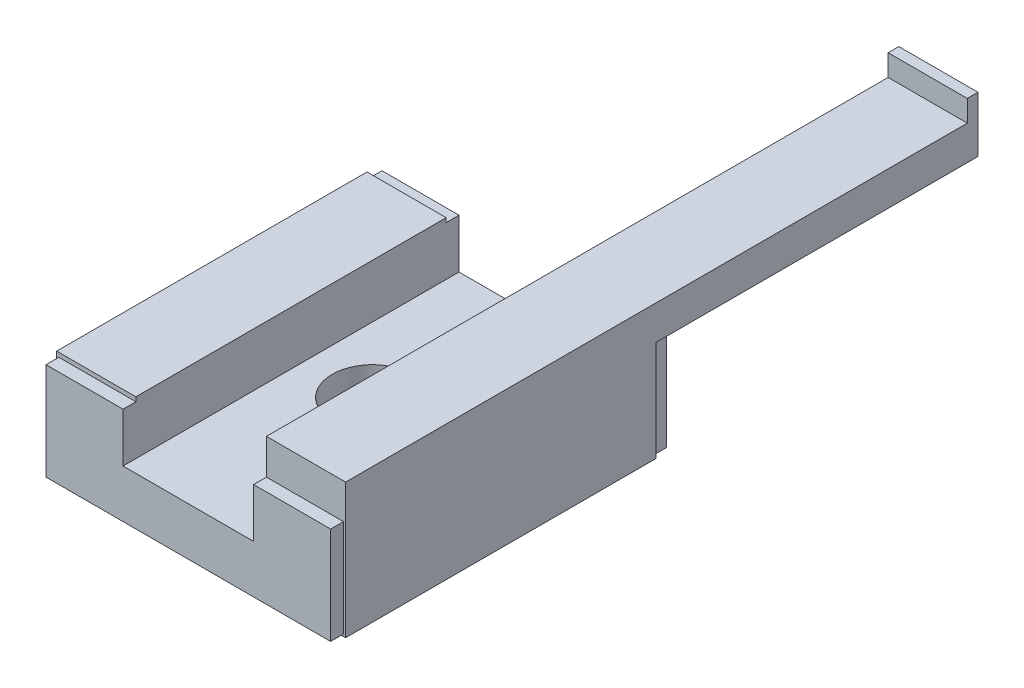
ISO-10303-21;
HEADER;
FILE_DESCRIPTION(('STEP AP214'),'2;1');
FILE_NAME('part.step','',(''),(''),'','','');
FILE_SCHEMA(('AUTOMOTIVE_DESIGN { 1 0 10303 214 1 1 1 1 }'));
ENDSEC;
DATA;
#1=APPLICATION_CONTEXT('core data for automotive mechanical design processes');
#2=APPLICATION_PROTOCOL_DEFINITION('international standard','automotive_design',2000,#1);
#3=PRODUCT_CONTEXT('',#1,'mechanical');
#4=PRODUCT('Part','Part','',(#3));
#5=PRODUCT_RELATED_PRODUCT_CATEGORY('part','',(#4));
#6=PRODUCT_DEFINITION_FORMATION('','',#4);
#7=PRODUCT_DEFINITION_CONTEXT('part definition',#1,'design');
#8=PRODUCT_DEFINITION('design','',#6,#7);
#9=PRODUCT_DEFINITION_SHAPE('','',#8);
#10=(LENGTH_UNIT() NAMED_UNIT(*) SI_UNIT(.MILLI.,.METRE.));
#11=(NAMED_UNIT(*) PLANE_ANGLE_UNIT() SI_UNIT($,.RADIAN.));
#12=(NAMED_UNIT(*) SI_UNIT($,.STERADIAN.) SOLID_ANGLE_UNIT());
#13=UNCERTAINTY_MEASURE_WITH_UNIT(LENGTH_MEASURE(1.E-05),#10,'distance_accuracy_value','');
#14=(GEOMETRIC_REPRESENTATION_CONTEXT(3) GLOBAL_UNCERTAINTY_ASSIGNED_CONTEXT((#13)) GLOBAL_UNIT_ASSIGNED_CONTEXT((#10,
#11,#12)) REPRESENTATION_CONTEXT('',''));
#15=CARTESIAN_POINT('',(0.,0.,0.));
#16=DIRECTION('',(0.,0.,1.));
#17=DIRECTION('',(1.,0.,0.));
#18=AXIS2_PLACEMENT_3D('',#15,#16,#17);
#19=CARTESIAN_POINT('',(13.5,12.6,31.4));
#20=DIRECTION('',(0.,-1.,0.));
#21=DIRECTION('',(0.,0.,-1.));
#22=AXIS2_PLACEMENT_3D('',#19,#20,#21);
#23=PLANE('',#22);
#24=DIRECTION('',(1.,0.,0.));
#25=VECTOR('',#24,1.);
#26=CARTESIAN_POINT('',(6.1,12.6,-27.9));
#27=LINE('',#26,#25);
#28=CARTESIAN_POINT('',(6.1,12.6,-27.9));
#29=VERTEX_POINT('',#28);
#30=CARTESIAN_POINT('',(13.5,12.6,-27.9));
#31=VERTEX_POINT('',#30);
#32=EDGE_CURVE('E11',#29,#31,#27,.T.);
#33=ORIENTED_EDGE('',*,*,#32,.F.);
#34=DIRECTION('',(0.,0.,-1.));
#35=VECTOR('',#34,1.);
#36=CARTESIAN_POINT('',(6.1,12.6,31.4));
#37=LINE('',#36,#35);
#38=CARTESIAN_POINT('',(6.1,12.6,30.2));
#39=VERTEX_POINT('',#38);
#40=EDGE_CURVE('E25',#39,#29,#37,.T.);
#41=ORIENTED_EDGE('',*,*,#40,.F.);
#42=DIRECTION('',(-1.,0.,0.));
#43=VECTOR('',#42,1.);
#44=CARTESIAN_POINT('',(13.5,12.6,30.2));
#45=LINE('',#44,#43);
#46=CARTESIAN_POINT('',(13.5,12.6,30.2));
#47=VERTEX_POINT('',#46);
#48=EDGE_CURVE('E899',#47,#39,#45,.T.);
#49=ORIENTED_EDGE('',*,*,#48,.F.);
#50=DIRECTION('',(0.,0.,-1.));
#51=VECTOR('',#50,1.);
#52=CARTESIAN_POINT('',(13.5,12.6,31.4));
#53=LINE('',#52,#51);
#54=EDGE_CURVE('E895',#47,#31,#53,.T.);
#55=ORIENTED_EDGE('',*,*,#54,.T.);
#56=EDGE_LOOP('',(#33,#41,#49,#55));
#57=FACE_BOUND('',#56,.T.);
#58=ADVANCED_FACE('F17',(#57),#23,.F.);
#59=CARTESIAN_POINT('',(13.5,0.,31.4));
#60=DIRECTION('',(-1.,0.,0.));
#61=DIRECTION('',(0.,0.,1.));
#62=AXIS2_PLACEMENT_3D('',#59,#60,#61);
#63=PLANE('',#62);
#64=DIRECTION('',(0.,1.,0.));
#65=VECTOR('',#64,1.);
#66=CARTESIAN_POINT('',(13.5,0.,30.2));
#67=LINE('',#66,#65);
#68=CARTESIAN_POINT('',(13.5,0.,30.2));
#69=VERTEX_POINT('',#68);
#70=EDGE_CURVE('E890',#69,#47,#67,.T.);
#71=ORIENTED_EDGE('',*,*,#70,.F.);
#72=DIRECTION('',(0.,0.,-1.));
#73=VECTOR('',#72,1.);
#74=CARTESIAN_POINT('',(13.5,0.,31.4));
#75=LINE('',#74,#73);
#76=CARTESIAN_POINT('',(13.5,0.,1.2));
#77=VERTEX_POINT('',#76);
#78=EDGE_CURVE('E886',#69,#77,#75,.T.);
#79=ORIENTED_EDGE('',*,*,#78,.T.);
#80=DIRECTION('',(0.,1.,0.));
#81=VECTOR('',#80,1.);
#82=CARTESIAN_POINT('',(13.5,0.,1.2));
#83=LINE('',#82,#81);
#84=CARTESIAN_POINT('',(13.5,9.4,1.2));
#85=VERTEX_POINT('',#84);
#86=EDGE_CURVE('E882',#77,#85,#83,.T.);
#87=ORIENTED_EDGE('',*,*,#86,.T.);
#88=DIRECTION('',(0.,0.,1.));
#89=VECTOR('',#88,1.);
#90=CARTESIAN_POINT('',(13.5,9.4,-28.9));
#91=LINE('',#90,#89);
#92=CARTESIAN_POINT('',(13.5,9.4,-28.9));
#93=VERTEX_POINT('',#92);
#94=EDGE_CURVE('E877',#93,#85,#91,.T.);
#95=ORIENTED_EDGE('',*,*,#94,.F.);
#96=DIRECTION('',(0.,1.,0.));
#97=VECTOR('',#96,1.);
#98=CARTESIAN_POINT('',(13.5,9.4,-28.9));
#99=LINE('',#98,#97);
#100=CARTESIAN_POINT('',(13.5,14.6,-28.9));
#101=VERTEX_POINT('',#100);
#102=EDGE_CURVE('E873',#93,#101,#99,.T.);
#103=ORIENTED_EDGE('',*,*,#102,.T.);
#104=DIRECTION('',(0.,0.,-1.));
#105=VECTOR('',#104,1.);
#106=CARTESIAN_POINT('',(13.5,14.6,-27.9));
#107=LINE('',#106,#105);
#108=CARTESIAN_POINT('',(13.5,14.6,-27.9));
#109=VERTEX_POINT('',#108);
#110=EDGE_CURVE('E868',#109,#101,#107,.T.);
#111=ORIENTED_EDGE('',*,*,#110,.F.);
#112=DIRECTION('',(0.,1.,0.));
#113=VECTOR('',#112,1.);
#114=CARTESIAN_POINT('',(13.5,12.6,-27.9));
#115=LINE('',#114,#113);
#116=EDGE_CURVE('E863',#31,#109,#115,.T.);
#117=ORIENTED_EDGE('',*,*,#116,.F.);
#118=ORIENTED_EDGE('',*,*,#54,.F.);
#119=EDGE_LOOP('',(#71,#79,#87,#95,#103,#111,#117,#118));
#120=FACE_BOUND('',#119,.T.);
#121=ADVANCED_FACE('F917',(#120),#63,.F.);
#122=CARTESIAN_POINT('',(0.,0.,-27.9));
#123=DIRECTION('',(0.,0.,1.));
#124=DIRECTION('',(1.,0.,0.));
#125=AXIS2_PLACEMENT_3D('',#122,#123,#124);
#126=PLANE('',#125);
#127=DIRECTION('',(-1.,0.,0.));
#128=VECTOR('',#127,1.);
#129=CARTESIAN_POINT('',(13.5,14.6,-27.9));
#130=LINE('',#129,#128);
#131=CARTESIAN_POINT('',(6.1,14.6,-27.9));
#132=VERTEX_POINT('',#131);
#133=EDGE_CURVE('E859',#109,#132,#130,.T.);
#134=ORIENTED_EDGE('',*,*,#133,.T.);
#135=DIRECTION('',(0.,-1.,0.));
#136=VECTOR('',#135,1.);
#137=CARTESIAN_POINT('',(6.1,14.6,-27.9));
#138=LINE('',#137,#136);
#139=EDGE_CURVE('E855',#132,#29,#138,.T.);
#140=ORIENTED_EDGE('',*,*,#139,.T.);
#141=ORIENTED_EDGE('',*,*,#32,.T.);
#142=ORIENTED_EDGE('',*,*,#116,.T.);
#143=EDGE_LOOP('',(#134,#140,#141,#142));
#144=FACE_BOUND('',#143,.T.);
#145=ADVANCED_FACE('F920',(#144),#126,.T.);
#146=CARTESIAN_POINT('',(6.1,12.6,31.4));
#147=DIRECTION('',(1.,0.,0.));
#148=DIRECTION('',(0.,0.,-1.));
#149=AXIS2_PLACEMENT_3D('',#146,#147,#148);
#150=PLANE('',#149);
#151=DIRECTION('',(0.,0.,1.));
#152=VECTOR('',#151,1.);
#153=CARTESIAN_POINT('',(6.1,9.4,-28.9));
#154=LINE('',#153,#152);
#155=CARTESIAN_POINT('',(6.1,9.4,-28.9));
#156=VERTEX_POINT('',#155);
#157=CARTESIAN_POINT('',(6.1,9.4,0.));
#158=VERTEX_POINT('',#157);
#159=EDGE_CURVE('E851',#156,#158,#154,.T.);
#160=ORIENTED_EDGE('',*,*,#159,.T.);
#161=DIRECTION('',(0.,-1.,0.));
#162=VECTOR('',#161,1.);
#163=CARTESIAN_POINT('',(6.1,12.6,0.));
#164=LINE('',#163,#162);
#165=CARTESIAN_POINT('',(6.1,4.7,0.));
#166=VERTEX_POINT('',#165);
#167=EDGE_CURVE('E847',#158,#166,#164,.T.);
#168=ORIENTED_EDGE('',*,*,#167,.T.);
#169=DIRECTION('',(0.,0.,-1.));
#170=VECTOR('',#169,1.);
#171=CARTESIAN_POINT('',(6.1,4.7,31.4));
#172=LINE('',#171,#170);
#173=CARTESIAN_POINT('',(6.1,4.7,31.4));
#174=VERTEX_POINT('',#173);
#175=EDGE_CURVE('E842',#174,#166,#172,.T.);
#176=ORIENTED_EDGE('',*,*,#175,.F.);
#177=DIRECTION('',(0.,-1.,0.));
#178=VECTOR('',#177,1.);
#179=CARTESIAN_POINT('',(6.1,12.6,31.4));
#180=LINE('',#179,#178);
#181=CARTESIAN_POINT('',(6.1,9.3,31.4));
#182=VERTEX_POINT('',#181);
#183=EDGE_CURVE('E837',#182,#174,#180,.T.);
#184=ORIENTED_EDGE('',*,*,#183,.F.);
#185=DIRECTION('',(0.,0.,1.));
#186=VECTOR('',#185,1.);
#187=CARTESIAN_POINT('',(6.1,9.3,30.2));
#188=LINE('',#187,#186);
#189=CARTESIAN_POINT('',(6.1,9.3,30.2));
#190=VERTEX_POINT('',#189);
#191=EDGE_CURVE('E832',#190,#182,#188,.T.);
#192=ORIENTED_EDGE('',*,*,#191,.F.);
#193=DIRECTION('',(0.,-1.,0.));
#194=VECTOR('',#193,1.);
#195=CARTESIAN_POINT('',(6.1,12.6,30.2));
#196=LINE('',#195,#194);
#197=EDGE_CURVE('E827',#39,#190,#196,.T.);
#198=ORIENTED_EDGE('',*,*,#197,.F.);
#199=ORIENTED_EDGE('',*,*,#40,.T.);
#200=ORIENTED_EDGE('',*,*,#139,.F.);
#201=DIRECTION('',(0.,0.,-1.));
#202=VECTOR('',#201,1.);
#203=CARTESIAN_POINT('',(6.1,14.6,-27.9));
#204=LINE('',#203,#202);
#205=CARTESIAN_POINT('',(6.1,14.6,-28.9));
#206=VERTEX_POINT('',#205);
#207=EDGE_CURVE('E823',#132,#206,#204,.T.);
#208=ORIENTED_EDGE('',*,*,#207,.T.);
#209=DIRECTION('',(0.,-1.,0.));
#210=VECTOR('',#209,1.);
#211=CARTESIAN_POINT('',(6.1,12.6,-28.9));
#212=LINE('',#211,#210);
#213=EDGE_CURVE('E819',#206,#156,#212,.T.);
#214=ORIENTED_EDGE('',*,*,#213,.T.);
#215=EDGE_LOOP('',(#160,#168,#176,#184,#192,#198,#199,#200,#208,#214));
#216=FACE_BOUND('',#215,.T.);
#217=ADVANCED_FACE('F910',(#216),#150,.F.);
#218=CARTESIAN_POINT('',(0.,0.,-28.9));
#219=DIRECTION('',(0.,0.,1.));
#220=DIRECTION('',(1.,0.,0.));
#221=AXIS2_PLACEMENT_3D('',#218,#219,#220);
#222=PLANE('',#221);
#223=ORIENTED_EDGE('',*,*,#213,.F.);
#224=DIRECTION('',(-1.,0.,0.));
#225=VECTOR('',#224,1.);
#226=CARTESIAN_POINT('',(13.5,14.6,-28.9));
#227=LINE('',#226,#225);
#228=EDGE_CURVE('E814',#101,#206,#227,.T.);
#229=ORIENTED_EDGE('',*,*,#228,.F.);
#230=ORIENTED_EDGE('',*,*,#102,.F.);
#231=DIRECTION('',(1.,0.,0.));
#232=VECTOR('',#231,1.);
#233=CARTESIAN_POINT('',(6.1,9.4,-28.9));
#234=LINE('',#233,#232);
#235=EDGE_CURVE('E809',#156,#93,#234,.T.);
#236=ORIENTED_EDGE('',*,*,#235,.F.);
#237=EDGE_LOOP('',(#223,#229,#230,#236));
#238=FACE_BOUND('',#237,.T.);
#239=ADVANCED_FACE('F931',(#238),#222,.F.);
#240=CARTESIAN_POINT('',(6.1,9.4,-28.9));
#241=DIRECTION('',(0.,-1.,0.));
#242=DIRECTION('',(0.,0.,-1.));
#243=AXIS2_PLACEMENT_3D('',#240,#241,#242);
#244=PLANE('',#243);
#245=DIRECTION('',(1.,0.,0.));
#246=VECTOR('',#245,1.);
#247=CARTESIAN_POINT('',(0.,9.4,0.));
#248=LINE('',#247,#246);
#249=CARTESIAN_POINT('',(13.3,9.4,0.));
#250=VERTEX_POINT('',#249);
#251=EDGE_CURVE('E804',#158,#250,#248,.T.);
#252=ORIENTED_EDGE('',*,*,#251,.F.);
#253=ORIENTED_EDGE('',*,*,#159,.F.);
#254=ORIENTED_EDGE('',*,*,#235,.T.);
#255=ORIENTED_EDGE('',*,*,#94,.T.);
#256=DIRECTION('',(1.,0.,0.));
#257=VECTOR('',#256,1.);
#258=CARTESIAN_POINT('',(6.1,9.4,1.2));
#259=LINE('',#258,#257);
#260=CARTESIAN_POINT('',(13.3,9.4,1.2));
#261=VERTEX_POINT('',#260);
#262=EDGE_CURVE('E799',#261,#85,#259,.T.);
#263=ORIENTED_EDGE('',*,*,#262,.F.);
#264=DIRECTION('',(0.,0.,-1.));
#265=VECTOR('',#264,1.);
#266=CARTESIAN_POINT('',(13.3,9.4,1.2));
#267=LINE('',#266,#265);
#268=EDGE_CURVE('E795',#261,#250,#267,.T.);
#269=ORIENTED_EDGE('',*,*,#268,.T.);
#270=EDGE_LOOP('',(#252,#253,#254,#255,#263,#269));
#271=FACE_BOUND('',#270,.T.);
#272=ADVANCED_FACE('F933',(#271),#244,.T.);
#273=CARTESIAN_POINT('',(13.3,9.7,1.2));
#274=DIRECTION('',(1.,0.,0.));
#275=DIRECTION('',(0.,0.,-1.));
#276=AXIS2_PLACEMENT_3D('',#273,#274,#275);
#277=PLANE('',#276);
#278=ORIENTED_EDGE('',*,*,#268,.F.);
#279=DIRECTION('',(0.,-1.,0.));
#280=VECTOR('',#279,1.);
#281=CARTESIAN_POINT('',(13.3,9.7,1.2));
#282=LINE('',#281,#280);
#283=CARTESIAN_POINT('',(13.3,0.2,1.2));
#284=VERTEX_POINT('',#283);
#285=EDGE_CURVE('E791',#261,#284,#282,.T.);
#286=ORIENTED_EDGE('',*,*,#285,.T.);
#287=DIRECTION('',(0.,0.,-1.));
#288=VECTOR('',#287,1.);
#289=CARTESIAN_POINT('',(13.3,0.2,1.2));
#290=LINE('',#289,#288);
#291=CARTESIAN_POINT('',(13.3,0.2,0.));
#292=VERTEX_POINT('',#291);
#293=EDGE_CURVE('E787',#284,#292,#290,.T.);
#294=ORIENTED_EDGE('',*,*,#293,.T.);
#295=DIRECTION('',(0.,-1.,0.));
#296=VECTOR('',#295,1.);
#297=CARTESIAN_POINT('',(13.3,9.7,0.));
#298=LINE('',#297,#296);
#299=EDGE_CURVE('E782',#250,#292,#298,.T.);
#300=ORIENTED_EDGE('',*,*,#299,.F.);
#301=EDGE_LOOP('',(#278,#286,#294,#300));
#302=FACE_BOUND('',#301,.T.);
#303=ADVANCED_FACE('F974',(#302),#277,.T.);
#304=CARTESIAN_POINT('',(0.,0.,0.));
#305=DIRECTION('',(0.,0.,1.));
#306=DIRECTION('',(1.,0.,0.));
#307=AXIS2_PLACEMENT_3D('',#304,#305,#306);
#308=PLANE('',#307);
#309=ORIENTED_EDGE('',*,*,#167,.F.);
#310=ORIENTED_EDGE('',*,*,#251,.T.);
#311=ORIENTED_EDGE('',*,*,#299,.T.);
#312=DIRECTION('',(1.,0.,0.));
#313=VECTOR('',#312,1.);
#314=CARTESIAN_POINT('',(-6.2,0.2,0.));
#315=LINE('',#314,#313);
#316=CARTESIAN_POINT('',(-13.3,0.2,0.));
#317=VERTEX_POINT('',#316);
#318=EDGE_CURVE('E777',#317,#292,#315,.T.);
#319=ORIENTED_EDGE('',*,*,#318,.F.);
#320=DIRECTION('',(0.,1.,0.));
#321=VECTOR('',#320,1.);
#322=CARTESIAN_POINT('',(-13.3,0.2,0.));
#323=LINE('',#322,#321);
#324=CARTESIAN_POINT('',(-13.3,9.3,0.));
#325=VERTEX_POINT('',#324);
#326=EDGE_CURVE('E773',#317,#325,#323,.T.);
#327=ORIENTED_EDGE('',*,*,#326,.T.);
#328=DIRECTION('',(1.,0.,0.));
#329=VECTOR('',#328,1.);
#330=CARTESIAN_POINT('',(-13.3,9.3,0.));
#331=LINE('',#330,#329);
#332=CARTESIAN_POINT('',(-6.1,9.3,0.));
#333=VERTEX_POINT('',#332);
#334=EDGE_CURVE('E769',#325,#333,#331,.T.);
#335=ORIENTED_EDGE('',*,*,#334,.T.);
#336=DIRECTION('',(0.,1.,0.));
#337=VECTOR('',#336,1.);
#338=CARTESIAN_POINT('',(-6.1,4.7,0.));
#339=LINE('',#338,#337);
#340=CARTESIAN_POINT('',(-6.1,4.7,0.));
#341=VERTEX_POINT('',#340);
#342=EDGE_CURVE('E764',#341,#333,#339,.T.);
#343=ORIENTED_EDGE('',*,*,#342,.F.);
#344=DIRECTION('',(-1.,0.,0.));
#345=VECTOR('',#344,1.);
#346=CARTESIAN_POINT('',(6.1,4.7,0.));
#347=LINE('',#346,#345);
#348=EDGE_CURVE('E759',#166,#341,#347,.T.);
#349=ORIENTED_EDGE('',*,*,#348,.F.);
#350=EDGE_LOOP('',(#309,#310,#311,#319,#327,#335,#343,#349));
#351=FACE_BOUND('',#350,.T.);
#352=ADVANCED_FACE('F939',(#351),#308,.F.);
#353=CARTESIAN_POINT('',(6.1,4.7,31.4));
#354=DIRECTION('',(0.,-1.,0.));
#355=DIRECTION('',(0.,0.,-1.));
#356=AXIS2_PLACEMENT_3D('',#353,#354,#355);
#357=PLANE('',#356);
#358=CARTESIAN_POINT('',(0.,4.7,14.2));
#359=DIRECTION('',(0.,1.,0.));
#360=DIRECTION('',(0.,0.,-1.));
#361=AXIS2_PLACEMENT_3D('',#358,#359,#360);
#362=CIRCLE('',#361,3.75);
#363=CARTESIAN_POINT('',(0.,4.7,17.95));
#364=VERTEX_POINT('',#363);
#365=CARTESIAN_POINT('',(0.,4.7,10.45));
#366=VERTEX_POINT('',#365);
#367=EDGE_CURVE('E754',#364,#366,#362,.T.);
#368=ORIENTED_EDGE('',*,*,#367,.F.);
#369=CARTESIAN_POINT('',(0.,4.7,14.2));
#370=DIRECTION('',(0.,1.,0.));
#371=DIRECTION('',(0.,0.,-1.));
#372=AXIS2_PLACEMENT_3D('',#369,#370,#371);
#373=CIRCLE('',#372,3.75);
#374=EDGE_CURVE('E749',#366,#364,#373,.T.);
#375=ORIENTED_EDGE('',*,*,#374,.F.);
#376=EDGE_LOOP('',(#368,#375));
#377=FACE_BOUND('',#376,.T.);
#378=ORIENTED_EDGE('',*,*,#348,.T.);
#379=DIRECTION('',(0.,0.,-1.));
#380=VECTOR('',#379,1.);
#381=CARTESIAN_POINT('',(-6.1,4.7,31.4));
#382=LINE('',#381,#380);
#383=CARTESIAN_POINT('',(-6.1,4.7,31.4));
#384=VERTEX_POINT('',#383);
#385=EDGE_CURVE('E744',#384,#341,#382,.T.);
#386=ORIENTED_EDGE('',*,*,#385,.F.);
#387=DIRECTION('',(-1.,0.,0.));
#388=VECTOR('',#387,1.);
#389=CARTESIAN_POINT('',(6.1,4.7,31.4));
#390=LINE('',#389,#388);
#391=EDGE_CURVE('E739',#174,#384,#390,.T.);
#392=ORIENTED_EDGE('',*,*,#391,.F.);
#393=ORIENTED_EDGE('',*,*,#175,.T.);
#394=EDGE_LOOP('',(#378,#386,#392,#393));
#395=FACE_BOUND('',#394,.T.);
#396=ADVANCED_FACE('F943',(#377,#395),#357,.F.);
#397=CARTESIAN_POINT('',(0.,0.,31.4));
#398=DIRECTION('',(0.,0.,1.));
#399=DIRECTION('',(1.,0.,0.));
#400=AXIS2_PLACEMENT_3D('',#397,#398,#399);
#401=PLANE('',#400);
#402=DIRECTION('',(1.,0.,0.));
#403=VECTOR('',#402,1.);
#404=CARTESIAN_POINT('',(6.1,9.3,31.4));
#405=LINE('',#404,#403);
#406=CARTESIAN_POINT('',(13.3,9.3,31.4));
#407=VERTEX_POINT('',#406);
#408=EDGE_CURVE('E734',#182,#407,#405,.T.);
#409=ORIENTED_EDGE('',*,*,#408,.F.);
#410=ORIENTED_EDGE('',*,*,#183,.T.);
#411=ORIENTED_EDGE('',*,*,#391,.T.);
#412=DIRECTION('',(0.,1.,0.));
#413=VECTOR('',#412,1.);
#414=CARTESIAN_POINT('',(-6.1,4.7,31.4));
#415=LINE('',#414,#413);
#416=CARTESIAN_POINT('',(-6.1,9.3,31.4));
#417=VERTEX_POINT('',#416);
#418=EDGE_CURVE('E730',#384,#417,#415,.T.);
#419=ORIENTED_EDGE('',*,*,#418,.T.);
#420=DIRECTION('',(1.,0.,0.));
#421=VECTOR('',#420,1.);
#422=CARTESIAN_POINT('',(-13.3,9.3,31.4));
#423=LINE('',#422,#421);
#424=CARTESIAN_POINT('',(-13.3,9.3,31.4));
#425=VERTEX_POINT('',#424);
#426=EDGE_CURVE('E725',#425,#417,#423,.T.);
#427=ORIENTED_EDGE('',*,*,#426,.F.);
#428=DIRECTION('',(0.,1.,0.));
#429=VECTOR('',#428,1.);
#430=CARTESIAN_POINT('',(-13.3,0.2,31.4));
#431=LINE('',#430,#429);
#432=CARTESIAN_POINT('',(-13.3,0.2,31.4));
#433=VERTEX_POINT('',#432);
#434=EDGE_CURVE('E720',#433,#425,#431,.T.);
#435=ORIENTED_EDGE('',*,*,#434,.F.);
#436=DIRECTION('',(1.,0.,0.));
#437=VECTOR('',#436,1.);
#438=CARTESIAN_POINT('',(-6.2,0.2,31.4));
#439=LINE('',#438,#437);
#440=CARTESIAN_POINT('',(13.3,0.2,31.4));
#441=VERTEX_POINT('',#440);
#442=EDGE_CURVE('E716',#433,#441,#439,.T.);
#443=ORIENTED_EDGE('',*,*,#442,.T.);
#444=DIRECTION('',(0.,-1.,0.));
#445=VECTOR('',#444,1.);
#446=CARTESIAN_POINT('',(13.3,9.3,31.4));
#447=LINE('',#446,#445);
#448=EDGE_CURVE('E711',#407,#441,#447,.T.);
#449=ORIENTED_EDGE('',*,*,#448,.F.);
#450=EDGE_LOOP('',(#409,#410,#411,#419,#427,#435,#443,#449));
#451=FACE_BOUND('',#450,.T.);
#452=ADVANCED_FACE('F946',(#451),#401,.T.);
#453=CARTESIAN_POINT('',(13.3,9.3,30.2));
#454=DIRECTION('',(-1.,0.,0.));
#455=DIRECTION('',(0.,0.,1.));
#456=AXIS2_PLACEMENT_3D('',#453,#454,#455);
#457=PLANE('',#456);
#458=ORIENTED_EDGE('',*,*,#448,.T.);
#459=DIRECTION('',(0.,0.,1.));
#460=VECTOR('',#459,1.);
#461=CARTESIAN_POINT('',(13.3,0.2,30.2));
#462=LINE('',#461,#460);
#463=CARTESIAN_POINT('',(13.3,0.2,30.2));
#464=VERTEX_POINT('',#463);
#465=EDGE_CURVE('E706',#464,#441,#462,.T.);
#466=ORIENTED_EDGE('',*,*,#465,.F.);
#467=DIRECTION('',(0.,-1.,0.));
#468=VECTOR('',#467,1.);
#469=CARTESIAN_POINT('',(13.3,9.3,30.2));
#470=LINE('',#469,#468);
#471=CARTESIAN_POINT('',(13.3,9.3,30.2));
#472=VERTEX_POINT('',#471);
#473=EDGE_CURVE('E701',#472,#464,#470,.T.);
#474=ORIENTED_EDGE('',*,*,#473,.F.);
#475=DIRECTION('',(0.,0.,1.));
#476=VECTOR('',#475,1.);
#477=CARTESIAN_POINT('',(13.3,9.3,30.2));
#478=LINE('',#477,#476);
#479=EDGE_CURVE('E696',#472,#407,#478,.T.);
#480=ORIENTED_EDGE('',*,*,#479,.T.);
#481=EDGE_LOOP('',(#458,#466,#474,#480));
#482=FACE_BOUND('',#481,.T.);
#483=ADVANCED_FACE('F953',(#482),#457,.F.);
#484=CARTESIAN_POINT('',(6.1,9.3,30.2));
#485=DIRECTION('',(0.,-1.,0.));
#486=DIRECTION('',(0.,0.,-1.));
#487=AXIS2_PLACEMENT_3D('',#484,#485,#486);
#488=PLANE('',#487);
#489=ORIENTED_EDGE('',*,*,#408,.T.);
#490=ORIENTED_EDGE('',*,*,#479,.F.);
#491=DIRECTION('',(1.,0.,0.));
#492=VECTOR('',#491,1.);
#493=CARTESIAN_POINT('',(6.1,9.3,30.2));
#494=LINE('',#493,#492);
#495=EDGE_CURVE('E691',#190,#472,#494,.T.);
#496=ORIENTED_EDGE('',*,*,#495,.F.);
#497=ORIENTED_EDGE('',*,*,#191,.T.);
#498=EDGE_LOOP('',(#489,#490,#496,#497));
#499=FACE_BOUND('',#498,.T.);
#500=ADVANCED_FACE('F949',(#499),#488,.F.);
#501=CARTESIAN_POINT('',(0.,0.,30.2));
#502=DIRECTION('',(0.,0.,1.));
#503=DIRECTION('',(1.,0.,0.));
#504=AXIS2_PLACEMENT_3D('',#501,#502,#503);
#505=PLANE('',#504);
#506=DIRECTION('',(0.707106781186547,-0.707106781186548,0.));
#507=VECTOR('',#506,1.);
#508=CARTESIAN_POINT('',(6.2,0.2,30.2));
#509=LINE('',#508,#507);
#510=CARTESIAN_POINT('',(6.2,0.2,30.2));
#511=VERTEX_POINT('',#510);
#512=CARTESIAN_POINT('',(6.4,0.,30.2));
#513=VERTEX_POINT('',#512);
#514=EDGE_CURVE('E687',#511,#513,#509,.T.);
#515=ORIENTED_EDGE('',*,*,#514,.T.);
#516=DIRECTION('',(1.,0.,0.));
#517=VECTOR('',#516,1.);
#518=CARTESIAN_POINT('',(-13.5,0.,30.2));
#519=LINE('',#518,#517);
#520=EDGE_CURVE('E682',#513,#69,#519,.T.);
#521=ORIENTED_EDGE('',*,*,#520,.T.);
#522=ORIENTED_EDGE('',*,*,#70,.T.);
#523=ORIENTED_EDGE('',*,*,#48,.T.);
#524=ORIENTED_EDGE('',*,*,#197,.T.);
#525=ORIENTED_EDGE('',*,*,#495,.T.);
#526=ORIENTED_EDGE('',*,*,#473,.T.);
#527=DIRECTION('',(-1.,0.,0.));
#528=VECTOR('',#527,1.);
#529=CARTESIAN_POINT('',(13.3,0.2,30.2));
#530=LINE('',#529,#528);
#531=EDGE_CURVE('E678',#464,#511,#530,.T.);
#532=ORIENTED_EDGE('',*,*,#531,.T.);
#533=EDGE_LOOP('',(#515,#521,#522,#523,#524,#525,#526,#532));
#534=FACE_BOUND('',#533,.T.);
#535=ADVANCED_FACE('F913',(#534),#505,.T.);
#536=CARTESIAN_POINT('',(-6.2,0.2,31.4));
#537=DIRECTION('',(0.,1.,0.));
#538=DIRECTION('',(0.,0.,1.));
#539=AXIS2_PLACEMENT_3D('',#536,#537,#538);
#540=PLANE('',#539);
#541=CARTESIAN_POINT('',(0.,0.2,14.2));
#542=DIRECTION('',(0.,-1.,0.));
#543=DIRECTION('',(0.,0.,1.));
#544=AXIS2_PLACEMENT_3D('',#541,#542,#543);
#545=CIRCLE('',#544,3.75);
#546=CARTESIAN_POINT('',(0.,0.2,10.45));
#547=VERTEX_POINT('',#546);
#548=CARTESIAN_POINT('',(0.,0.2,17.95));
#549=VERTEX_POINT('',#548);
#550=EDGE_CURVE('E673',#547,#549,#545,.T.);
#551=ORIENTED_EDGE('',*,*,#550,.F.);
#552=CARTESIAN_POINT('',(0.,0.2,14.2));
#553=DIRECTION('',(0.,-1.,0.));
#554=DIRECTION('',(0.,0.,1.));
#555=AXIS2_PLACEMENT_3D('',#552,#553,#554);
#556=CIRCLE('',#555,3.75);
#557=EDGE_CURVE('E668',#549,#547,#556,.T.);
#558=ORIENTED_EDGE('',*,*,#557,.F.);
#559=EDGE_LOOP('',(#551,#558));
#560=FACE_BOUND('',#559,.T.);
#561=CARTESIAN_POINT('',(0.,0.2,24.7));
#562=DIRECTION('',(0.,-1.,0.));
#563=DIRECTION('',(0.,0.,1.));
#564=AXIS2_PLACEMENT_3D('',#561,#562,#563);
#565=CIRCLE('',#564,1.5);
#566=CARTESIAN_POINT('',(0.,0.2,23.2));
#567=VERTEX_POINT('',#566);
#568=CARTESIAN_POINT('',(0.,0.2,26.2));
#569=VERTEX_POINT('',#568);
#570=EDGE_CURVE('E306',#567,#569,#565,.T.);
#571=ORIENTED_EDGE('',*,*,#570,.F.);
#572=CARTESIAN_POINT('',(0.,0.2,24.7));
#573=DIRECTION('',(0.,-1.,0.));
#574=DIRECTION('',(0.,0.,1.));
#575=AXIS2_PLACEMENT_3D('',#572,#573,#574);
#576=CIRCLE('',#575,1.5);
#577=EDGE_CURVE('E661',#569,#567,#576,.T.);
#578=ORIENTED_EDGE('',*,*,#577,.F.);
#579=EDGE_LOOP('',(#571,#578));
#580=FACE_BOUND('',#579,.T.);
#581=ORIENTED_EDGE('',*,*,#442,.F.);
#582=DIRECTION('',(0.,0.,1.));
#583=VECTOR('',#582,1.);
#584=CARTESIAN_POINT('',(-13.3,0.2,30.2));
#585=LINE('',#584,#583);
#586=CARTESIAN_POINT('',(-13.3,0.2,30.2));
#587=VERTEX_POINT('',#586);
#588=EDGE_CURVE('E656',#587,#433,#585,.T.);
#589=ORIENTED_EDGE('',*,*,#588,.F.);
#590=DIRECTION('',(-1.,0.,0.));
#591=VECTOR('',#590,1.);
#592=CARTESIAN_POINT('',(13.3,0.2,30.2));
#593=LINE('',#592,#591);
#594=CARTESIAN_POINT('',(-6.2,0.2,30.2));
#595=VERTEX_POINT('',#594);
#596=EDGE_CURVE('E651',#595,#587,#593,.T.);
#597=ORIENTED_EDGE('',*,*,#596,.F.);
#598=DIRECTION('',(0.,0.,-1.));
#599=VECTOR('',#598,1.);
#600=CARTESIAN_POINT('',(-6.2,0.2,31.4));
#601=LINE('',#600,#599);
#602=CARTESIAN_POINT('',(-6.2,0.2,1.2));
#603=VERTEX_POINT('',#602);
#604=EDGE_CURVE('E647',#595,#603,#601,.T.);
#605=ORIENTED_EDGE('',*,*,#604,.T.);
#606=DIRECTION('',(-1.,0.,0.));
#607=VECTOR('',#606,1.);
#608=CARTESIAN_POINT('',(13.3,0.2,1.2));
#609=LINE('',#608,#607);
#610=CARTESIAN_POINT('',(-13.3,0.2,1.2));
#611=VERTEX_POINT('',#610);
#612=EDGE_CURVE('E643',#603,#611,#609,.T.);
#613=ORIENTED_EDGE('',*,*,#612,.T.);
#614=DIRECTION('',(0.,0.,-1.));
#615=VECTOR('',#614,1.);
#616=CARTESIAN_POINT('',(-13.3,0.2,1.2));
#617=LINE('',#616,#615);
#618=EDGE_CURVE('E638',#611,#317,#617,.T.);
#619=ORIENTED_EDGE('',*,*,#618,.T.);
#620=ORIENTED_EDGE('',*,*,#318,.T.);
#621=ORIENTED_EDGE('',*,*,#293,.F.);
#622=DIRECTION('',(-1.,0.,0.));
#623=VECTOR('',#622,1.);
#624=CARTESIAN_POINT('',(13.3,0.2,1.2));
#625=LINE('',#624,#623);
#626=CARTESIAN_POINT('',(6.2,0.2,1.2));
#627=VERTEX_POINT('',#626);
#628=EDGE_CURVE('E634',#284,#627,#625,.T.);
#629=ORIENTED_EDGE('',*,*,#628,.T.);
#630=DIRECTION('',(0.,0.,-1.));
#631=VECTOR('',#630,1.);
#632=CARTESIAN_POINT('',(6.2,0.2,31.4));
#633=LINE('',#632,#631);
#634=EDGE_CURVE('E629',#511,#627,#633,.T.);
#635=ORIENTED_EDGE('',*,*,#634,.F.);
#636=ORIENTED_EDGE('',*,*,#531,.F.);
#637=ORIENTED_EDGE('',*,*,#465,.T.);
#638=EDGE_LOOP('',(#581,#589,#597,#605,#613,#619,#620,#621,#629,#635,#636,#637));
#639=FACE_BOUND('',#638,.T.);
#640=ADVANCED_FACE('F956',(#560,#580,#639),#540,.F.);
#641=CARTESIAN_POINT('',(6.2,0.2,31.4));
#642=DIRECTION('',(0.707106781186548,0.707106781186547,0.));
#643=DIRECTION('',(-0.707106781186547,0.707106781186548,0.));
#644=AXIS2_PLACEMENT_3D('',#641,#642,#643);
#645=PLANE('',#644);
#646=ORIENTED_EDGE('',*,*,#514,.F.);
#647=ORIENTED_EDGE('',*,*,#634,.T.);
#648=DIRECTION('',(0.707106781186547,-0.707106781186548,0.));
#649=VECTOR('',#648,1.);
#650=CARTESIAN_POINT('',(6.2,0.2,1.2));
#651=LINE('',#650,#649);
#652=CARTESIAN_POINT('',(6.4,0.,1.2));
#653=VERTEX_POINT('',#652);
#654=EDGE_CURVE('E625',#627,#653,#651,.T.);
#655=ORIENTED_EDGE('',*,*,#654,.T.);
#656=DIRECTION('',(0.,0.,-1.));
#657=VECTOR('',#656,1.);
#658=CARTESIAN_POINT('',(6.4,0.,31.4));
#659=LINE('',#658,#657);
#660=EDGE_CURVE('E620',#513,#653,#659,.T.);
#661=ORIENTED_EDGE('',*,*,#660,.F.);
#662=EDGE_LOOP('',(#646,#647,#655,#661));
#663=FACE_BOUND('',#662,.T.);
#664=ADVANCED_FACE('F963',(#663),#645,.F.);
#665=CARTESIAN_POINT('',(6.4,0.,31.4));
#666=DIRECTION('',(0.,1.,0.));
#667=DIRECTION('',(0.,0.,1.));
#668=AXIS2_PLACEMENT_3D('',#665,#666,#667);
#669=PLANE('',#668);
#670=CARTESIAN_POINT('',(10.,0.,24.7));
#671=DIRECTION('',(0.,-1.,0.));
#672=DIRECTION('',(0.,0.,-1.));
#673=AXIS2_PLACEMENT_3D('',#670,#671,#672);
#674=CIRCLE('',#673,2.);
#675=CARTESIAN_POINT('',(10.,0.,26.7));
#676=VERTEX_POINT('',#675);
#677=CARTESIAN_POINT('',(10.,0.,22.7));
#678=VERTEX_POINT('',#677);
#679=EDGE_CURVE('E615',#676,#678,#674,.T.);
#680=ORIENTED_EDGE('',*,*,#679,.F.);
#681=CARTESIAN_POINT('',(10.,0.,24.7));
#682=DIRECTION('',(0.,-1.,0.));
#683=DIRECTION('',(0.,0.,-1.));
#684=AXIS2_PLACEMENT_3D('',#681,#682,#683);
#685=CIRCLE('',#684,2.);
#686=EDGE_CURVE('E610',#678,#676,#685,.T.);
#687=ORIENTED_EDGE('',*,*,#686,.F.);
#688=EDGE_LOOP('',(#680,#687));
#689=FACE_BOUND('',#688,.T.);
#690=CARTESIAN_POINT('',(10.,0.,6.7));
#691=DIRECTION('',(0.,-1.,0.));
#692=DIRECTION('',(0.,0.,-1.));
#693=AXIS2_PLACEMENT_3D('',#690,#691,#692);
#694=CIRCLE('',#693,2.);
#695=CARTESIAN_POINT('',(10.,0.,8.7));
#696=VERTEX_POINT('',#695);
#697=CARTESIAN_POINT('',(10.,0.,4.7));
#698=VERTEX_POINT('',#697);
#699=EDGE_CURVE('E605',#696,#698,#694,.T.);
#700=ORIENTED_EDGE('',*,*,#699,.F.);
#701=CARTESIAN_POINT('',(10.,0.,6.7));
#702=DIRECTION('',(0.,-1.,0.));
#703=DIRECTION('',(0.,0.,-1.));
#704=AXIS2_PLACEMENT_3D('',#701,#702,#703);
#705=CIRCLE('',#704,2.);
#706=EDGE_CURVE('E600',#698,#696,#705,.T.);
#707=ORIENTED_EDGE('',*,*,#706,.F.);
#708=EDGE_LOOP('',(#700,#707));
#709=FACE_BOUND('',#708,.T.);
#710=ORIENTED_EDGE('',*,*,#520,.F.);
#711=ORIENTED_EDGE('',*,*,#660,.T.);
#712=DIRECTION('',(1.,0.,0.));
#713=VECTOR('',#712,1.);
#714=CARTESIAN_POINT('',(-13.5,0.,1.2));
#715=LINE('',#714,#713);
#716=EDGE_CURVE('E595',#653,#77,#715,.T.);
#717=ORIENTED_EDGE('',*,*,#716,.T.);
#718=ORIENTED_EDGE('',*,*,#78,.F.);
#719=EDGE_LOOP('',(#710,#711,#717,#718));
#720=FACE_BOUND('',#719,.T.);
#721=ADVANCED_FACE('F967',(#689,#709,#720),#669,.F.);
#722=CARTESIAN_POINT('',(0.,0.,1.2));
#723=DIRECTION('',(0.,0.,1.));
#724=DIRECTION('',(1.,0.,0.));
#725=AXIS2_PLACEMENT_3D('',#722,#723,#724);
#726=PLANE('',#725);
#727=ORIENTED_EDGE('',*,*,#285,.F.);
#728=ORIENTED_EDGE('',*,*,#262,.T.);
#729=ORIENTED_EDGE('',*,*,#86,.F.);
#730=ORIENTED_EDGE('',*,*,#716,.F.);
#731=ORIENTED_EDGE('',*,*,#654,.F.);
#732=ORIENTED_EDGE('',*,*,#628,.F.);
#733=EDGE_LOOP('',(#727,#728,#729,#730,#731,#732));
#734=FACE_BOUND('',#733,.T.);
#735=ADVANCED_FACE('F972',(#734),#726,.F.);
#736=CARTESIAN_POINT('',(10.,0.379,6.7));
#737=DIRECTION('',(0.,-1.,0.));
#738=DIRECTION('',(-1.,0.,0.));
#739=AXIS2_PLACEMENT_3D('',#736,#737,#738);
#740=CONICAL_SURFACE('',#739,1.621,0.785398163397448);
#741=DIRECTION('',(0.,-0.707106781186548,0.707106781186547));
#742=VECTOR('',#741,1.);
#743=CARTESIAN_POINT('',(10.,0.379,8.321));
#744=LINE('',#743,#742);
#745=CARTESIAN_POINT('',(10.,0.379,8.321));
#746=VERTEX_POINT('',#745);
#747=EDGE_CURVE('E590',#746,#696,#744,.T.);
#748=ORIENTED_EDGE('',*,*,#747,.F.);
#749=CARTESIAN_POINT('',(10.,0.379,6.7));
#750=DIRECTION('',(0.,-1.,0.));
#751=DIRECTION('',(0.,0.,-1.));
#752=AXIS2_PLACEMENT_3D('',#749,#750,#751);
#753=CIRCLE('',#752,1.621);
#754=CARTESIAN_POINT('',(10.,0.379,5.079));
#755=VERTEX_POINT('',#754);
#756=EDGE_CURVE('E585',#755,#746,#753,.T.);
#757=ORIENTED_EDGE('',*,*,#756,.F.);
#758=DIRECTION('',(0.,-0.707106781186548,-0.707106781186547));
#759=VECTOR('',#758,1.);
#760=CARTESIAN_POINT('',(10.,0.379,5.079));
#761=LINE('',#760,#759);
#762=EDGE_CURVE('E580',#755,#698,#761,.T.);
#763=ORIENTED_EDGE('',*,*,#762,.T.);
#764=ORIENTED_EDGE('',*,*,#706,.T.);
#765=EDGE_LOOP('',(#748,#757,#763,#764));
#766=FACE_BOUND('',#765,.T.);
#767=ADVANCED_FACE('F1070',(#766),#740,.F.);
#768=CARTESIAN_POINT('',(10.,0.379,6.7));
#769=DIRECTION('',(0.,-1.,0.));
#770=DIRECTION('',(1.,0.,0.));
#771=AXIS2_PLACEMENT_3D('',#768,#769,#770);
#772=CONICAL_SURFACE('',#771,1.621,0.785398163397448);
#773=ORIENTED_EDGE('',*,*,#747,.T.);
#774=ORIENTED_EDGE('',*,*,#699,.T.);
#775=ORIENTED_EDGE('',*,*,#762,.F.);
#776=CARTESIAN_POINT('',(10.,0.379,6.7));
#777=DIRECTION('',(0.,-1.,0.));
#778=DIRECTION('',(0.,0.,-1.));
#779=AXIS2_PLACEMENT_3D('',#776,#777,#778);
#780=CIRCLE('',#779,1.621);
#781=EDGE_CURVE('E575',#746,#755,#780,.T.);
#782=ORIENTED_EDGE('',*,*,#781,.F.);
#783=EDGE_LOOP('',(#773,#774,#775,#782));
#784=FACE_BOUND('',#783,.T.);
#785=ADVANCED_FACE('F1073',(#784),#772,.F.);
#786=CARTESIAN_POINT('',(10.,0.,6.7));
#787=DIRECTION('',(0.,-1.,0.));
#788=DIRECTION('',(1.,0.,0.));
#789=AXIS2_PLACEMENT_3D('',#786,#787,#788);
#790=CYLINDRICAL_SURFACE('',#789,1.621);
#791=DIRECTION('',(0.,-1.,0.));
#792=VECTOR('',#791,1.);
#793=CARTESIAN_POINT('',(10.,4.,8.321));
#794=LINE('',#793,#792);
#795=CARTESIAN_POINT('',(10.,4.,8.321));
#796=VERTEX_POINT('',#795);
#797=EDGE_CURVE('E570',#796,#746,#794,.T.);
#798=ORIENTED_EDGE('',*,*,#797,.T.);
#799=ORIENTED_EDGE('',*,*,#781,.T.);
#800=DIRECTION('',(0.,-1.,0.));
#801=VECTOR('',#800,1.);
#802=CARTESIAN_POINT('',(10.,4.,5.079));
#803=LINE('',#802,#801);
#804=CARTESIAN_POINT('',(10.,4.,5.079));
#805=VERTEX_POINT('',#804);
#806=EDGE_CURVE('E565',#805,#755,#803,.T.);
#807=ORIENTED_EDGE('',*,*,#806,.F.);
#808=CARTESIAN_POINT('',(10.,4.,6.7));
#809=DIRECTION('',(0.,-1.,0.));
#810=DIRECTION('',(0.,0.,-1.));
#811=AXIS2_PLACEMENT_3D('',#808,#809,#810);
#812=CIRCLE('',#811,1.621);
#813=EDGE_CURVE('E560',#796,#805,#812,.T.);
#814=ORIENTED_EDGE('',*,*,#813,.F.);
#815=EDGE_LOOP('',(#798,#799,#807,#814));
#816=FACE_BOUND('',#815,.T.);
#817=ADVANCED_FACE('F1077',(#816),#790,.F.);
#818=CARTESIAN_POINT('',(10.,4.,6.7));
#819=DIRECTION('',(0.,-1.,0.));
#820=DIRECTION('',(0.,0.,-1.));
#821=AXIS2_PLACEMENT_3D('',#818,#819,#820);
#822=PLANE('',#821);
#823=CARTESIAN_POINT('',(10.,4.,6.7));
#824=DIRECTION('',(0.,-1.,0.));
#825=DIRECTION('',(0.,0.,-1.));
#826=AXIS2_PLACEMENT_3D('',#823,#824,#825);
#827=CIRCLE('',#826,1.621);
#828=EDGE_CURVE('E555',#805,#796,#827,.T.);
#829=ORIENTED_EDGE('',*,*,#828,.T.);
#830=ORIENTED_EDGE('',*,*,#813,.T.);
#831=EDGE_LOOP('',(#829,#830));
#832=FACE_BOUND('',#831,.T.);
#833=ADVANCED_FACE('F1081',(#832),#822,.T.);
#834=CARTESIAN_POINT('',(10.,0.,6.7));
#835=DIRECTION('',(0.,-1.,0.));
#836=DIRECTION('',(-1.,0.,0.));
#837=AXIS2_PLACEMENT_3D('',#834,#835,#836);
#838=CYLINDRICAL_SURFACE('',#837,1.621);
#839=ORIENTED_EDGE('',*,*,#797,.F.);
#840=ORIENTED_EDGE('',*,*,#828,.F.);
#841=ORIENTED_EDGE('',*,*,#806,.T.);
#842=ORIENTED_EDGE('',*,*,#756,.T.);
#843=EDGE_LOOP('',(#839,#840,#841,#842));
#844=FACE_BOUND('',#843,.T.);
#845=ADVANCED_FACE('F1085',(#844),#838,.F.);
#846=CARTESIAN_POINT('',(10.,0.379,24.7));
#847=DIRECTION('',(0.,-1.,0.));
#848=DIRECTION('',(-1.,0.,0.));
#849=AXIS2_PLACEMENT_3D('',#846,#847,#848);
#850=CONICAL_SURFACE('',#849,1.621,0.785398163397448);
#851=DIRECTION('',(0.,-0.707106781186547,0.707106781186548));
#852=VECTOR('',#851,1.);
#853=CARTESIAN_POINT('',(10.,0.379000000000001,26.321));
#854=LINE('',#853,#852);
#855=CARTESIAN_POINT('',(10.,0.379,26.321));
#856=VERTEX_POINT('',#855);
#857=EDGE_CURVE('E550',#856,#676,#854,.T.);
#858=ORIENTED_EDGE('',*,*,#857,.F.);
#859=CARTESIAN_POINT('',(10.,0.379,24.7));
#860=DIRECTION('',(0.,-1.,0.));
#861=DIRECTION('',(0.,0.,-1.));
#862=AXIS2_PLACEMENT_3D('',#859,#860,#861);
#863=CIRCLE('',#862,1.621);
#864=CARTESIAN_POINT('',(10.,0.379,23.079));
#865=VERTEX_POINT('',#864);
#866=EDGE_CURVE('E545',#865,#856,#863,.T.);
#867=ORIENTED_EDGE('',*,*,#866,.F.);
#868=DIRECTION('',(0.,-0.707106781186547,-0.707106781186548));
#869=VECTOR('',#868,1.);
#870=CARTESIAN_POINT('',(10.,0.379000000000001,23.079));
#871=LINE('',#870,#869);
#872=EDGE_CURVE('E540',#865,#678,#871,.T.);
#873=ORIENTED_EDGE('',*,*,#872,.T.);
#874=ORIENTED_EDGE('',*,*,#686,.T.);
#875=EDGE_LOOP('',(#858,#867,#873,#874));
#876=FACE_BOUND('',#875,.T.);
#877=ADVANCED_FACE('F1089',(#876),#850,.F.);
#878=CARTESIAN_POINT('',(10.,0.379,24.7));
#879=DIRECTION('',(0.,-1.,0.));
#880=DIRECTION('',(1.,0.,0.));
#881=AXIS2_PLACEMENT_3D('',#878,#879,#880);
#882=CONICAL_SURFACE('',#881,1.621,0.785398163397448);
#883=ORIENTED_EDGE('',*,*,#857,.T.);
#884=ORIENTED_EDGE('',*,*,#679,.T.);
#885=ORIENTED_EDGE('',*,*,#872,.F.);
#886=CARTESIAN_POINT('',(10.,0.379,24.7));
#887=DIRECTION('',(0.,-1.,0.));
#888=DIRECTION('',(0.,0.,-1.));
#889=AXIS2_PLACEMENT_3D('',#886,#887,#888);
#890=CIRCLE('',#889,1.621);
#891=EDGE_CURVE('E535',#856,#865,#890,.T.);
#892=ORIENTED_EDGE('',*,*,#891,.F.);
#893=EDGE_LOOP('',(#883,#884,#885,#892));
#894=FACE_BOUND('',#893,.T.);
#895=ADVANCED_FACE('F1093',(#894),#882,.F.);
#896=CARTESIAN_POINT('',(10.,0.,24.7));
#897=DIRECTION('',(0.,-1.,0.));
#898=DIRECTION('',(1.,0.,0.));
#899=AXIS2_PLACEMENT_3D('',#896,#897,#898);
#900=CYLINDRICAL_SURFACE('',#899,1.621);
#901=DIRECTION('',(0.,-1.,0.));
#902=VECTOR('',#901,1.);
#903=CARTESIAN_POINT('',(10.,4.,26.321));
#904=LINE('',#903,#902);
#905=CARTESIAN_POINT('',(10.,4.,26.321));
#906=VERTEX_POINT('',#905);
#907=EDGE_CURVE('E530',#906,#856,#904,.T.);
#908=ORIENTED_EDGE('',*,*,#907,.T.);
#909=ORIENTED_EDGE('',*,*,#891,.T.);
#910=DIRECTION('',(0.,-1.,0.));
#911=VECTOR('',#910,1.);
#912=CARTESIAN_POINT('',(10.,4.,23.079));
#913=LINE('',#912,#911);
#914=CARTESIAN_POINT('',(10.,4.,23.079));
#915=VERTEX_POINT('',#914);
#916=EDGE_CURVE('E525',#915,#865,#913,.T.);
#917=ORIENTED_EDGE('',*,*,#916,.F.);
#918=CARTESIAN_POINT('',(10.,4.,24.7));
#919=DIRECTION('',(0.,-1.,0.));
#920=DIRECTION('',(0.,0.,-1.));
#921=AXIS2_PLACEMENT_3D('',#918,#919,#920);
#922=CIRCLE('',#921,1.621);
#923=EDGE_CURVE('E520',#906,#915,#922,.T.);
#924=ORIENTED_EDGE('',*,*,#923,.F.);
#925=EDGE_LOOP('',(#908,#909,#917,#924));
#926=FACE_BOUND('',#925,.T.);
#927=ADVANCED_FACE('F1097',(#926),#900,.F.);
#928=CARTESIAN_POINT('',(10.,4.,24.7));
#929=DIRECTION('',(0.,-1.,0.));
#930=DIRECTION('',(0.,0.,-1.));
#931=AXIS2_PLACEMENT_3D('',#928,#929,#930);
#932=PLANE('',#931);
#933=CARTESIAN_POINT('',(10.,4.,24.7));
#934=DIRECTION('',(0.,-1.,0.));
#935=DIRECTION('',(0.,0.,-1.));
#936=AXIS2_PLACEMENT_3D('',#933,#934,#935);
#937=CIRCLE('',#936,1.621);
#938=EDGE_CURVE('E515',#915,#906,#937,.T.);
#939=ORIENTED_EDGE('',*,*,#938,.T.);
#940=ORIENTED_EDGE('',*,*,#923,.T.);
#941=EDGE_LOOP('',(#939,#940));
#942=FACE_BOUND('',#941,.T.);
#943=ADVANCED_FACE('F1101',(#942),#932,.T.);
#944=CARTESIAN_POINT('',(10.,0.,24.7));
#945=DIRECTION('',(0.,-1.,0.));
#946=DIRECTION('',(-1.,0.,0.));
#947=AXIS2_PLACEMENT_3D('',#944,#945,#946);
#948=CYLINDRICAL_SURFACE('',#947,1.621);
#949=ORIENTED_EDGE('',*,*,#907,.F.);
#950=ORIENTED_EDGE('',*,*,#938,.F.);
#951=ORIENTED_EDGE('',*,*,#916,.T.);
#952=ORIENTED_EDGE('',*,*,#866,.T.);
#953=EDGE_LOOP('',(#949,#950,#951,#952));
#954=FACE_BOUND('',#953,.T.);
#955=ADVANCED_FACE('F1105',(#954),#948,.F.);
#956=CARTESIAN_POINT('',(-13.3,0.2,1.2));
#957=DIRECTION('',(-1.,0.,0.));
#958=DIRECTION('',(0.,0.,1.));
#959=AXIS2_PLACEMENT_3D('',#956,#957,#958);
#960=PLANE('',#959);
#961=ORIENTED_EDGE('',*,*,#326,.F.);
#962=ORIENTED_EDGE('',*,*,#618,.F.);
#963=DIRECTION('',(0.,1.,0.));
#964=VECTOR('',#963,1.);
#965=CARTESIAN_POINT('',(-13.3,0.2,1.2));
#966=LINE('',#965,#964);
#967=CARTESIAN_POINT('',(-13.3,9.3,1.2));
#968=VERTEX_POINT('',#967);
#969=EDGE_CURVE('E511',#611,#968,#966,.T.);
#970=ORIENTED_EDGE('',*,*,#969,.T.);
#971=DIRECTION('',(0.,0.,-1.));
#972=VECTOR('',#971,1.);
#973=CARTESIAN_POINT('',(-13.3,9.3,1.2));
#974=LINE('',#973,#972);
#975=EDGE_CURVE('E506',#968,#325,#974,.T.);
#976=ORIENTED_EDGE('',*,*,#975,.T.);
#977=EDGE_LOOP('',(#961,#962,#970,#976));
#978=FACE_BOUND('',#977,.T.);
#979=ADVANCED_FACE('F980',(#978),#960,.T.);
#980=CARTESIAN_POINT('',(-13.3,9.3,1.2));
#981=DIRECTION('',(0.,1.,0.));
#982=DIRECTION('',(0.,0.,1.));
#983=AXIS2_PLACEMENT_3D('',#980,#981,#982);
#984=PLANE('',#983);
#985=ORIENTED_EDGE('',*,*,#334,.F.);
#986=ORIENTED_EDGE('',*,*,#975,.F.);
#987=DIRECTION('',(1.,0.,0.));
#988=VECTOR('',#987,1.);
#989=CARTESIAN_POINT('',(-13.3,9.3,1.2));
#990=LINE('',#989,#988);
#991=CARTESIAN_POINT('',(-6.1,9.3,1.2));
#992=VERTEX_POINT('',#991);
#993=EDGE_CURVE('E502',#968,#992,#990,.T.);
#994=ORIENTED_EDGE('',*,*,#993,.T.);
#995=DIRECTION('',(0.,0.,-1.));
#996=VECTOR('',#995,1.);
#997=CARTESIAN_POINT('',(-6.1,9.3,1.2));
#998=LINE('',#997,#996);
#999=EDGE_CURVE('E497',#992,#333,#998,.T.);
#1000=ORIENTED_EDGE('',*,*,#999,.T.);
#1001=EDGE_LOOP('',(#985,#986,#994,#1000));
#1002=FACE_BOUND('',#1001,.T.);
#1003=ADVANCED_FACE('F985',(#1002),#984,.T.);
#1004=CARTESIAN_POINT('',(-6.1,4.7,31.4));
#1005=DIRECTION('',(-1.,0.,0.));
#1006=DIRECTION('',(0.,0.,1.));
#1007=AXIS2_PLACEMENT_3D('',#1004,#1005,#1006);
#1008=PLANE('',#1007);
#1009=DIRECTION('',(0.,1.,0.));
#1010=VECTOR('',#1009,1.);
#1011=CARTESIAN_POINT('',(-6.1,9.3,30.2));
#1012=LINE('',#1011,#1010);
#1013=CARTESIAN_POINT('',(-6.1,9.3,30.2));
#1014=VERTEX_POINT('',#1013);
#1015=CARTESIAN_POINT('',(-6.1,9.7,30.2));
#1016=VERTEX_POINT('',#1015);
#1017=EDGE_CURVE('E492',#1014,#1016,#1012,.T.);
#1018=ORIENTED_EDGE('',*,*,#1017,.F.);
#1019=DIRECTION('',(0.,0.,1.));
#1020=VECTOR('',#1019,1.);
#1021=CARTESIAN_POINT('',(-6.1,9.3,30.2));
#1022=LINE('',#1021,#1020);
#1023=EDGE_CURVE('E487',#1014,#417,#1022,.T.);
#1024=ORIENTED_EDGE('',*,*,#1023,.T.);
#1025=ORIENTED_EDGE('',*,*,#418,.F.);
#1026=ORIENTED_EDGE('',*,*,#385,.T.);
#1027=ORIENTED_EDGE('',*,*,#342,.T.);
#1028=ORIENTED_EDGE('',*,*,#999,.F.);
#1029=DIRECTION('',(0.,1.,0.));
#1030=VECTOR('',#1029,1.);
#1031=CARTESIAN_POINT('',(-6.1,9.3,1.2));
#1032=LINE('',#1031,#1030);
#1033=CARTESIAN_POINT('',(-6.1,9.7,1.2));
#1034=VERTEX_POINT('',#1033);
#1035=EDGE_CURVE('E483',#992,#1034,#1032,.T.);
#1036=ORIENTED_EDGE('',*,*,#1035,.T.);
#1037=DIRECTION('',(0.,0.,-1.));
#1038=VECTOR('',#1037,1.);
#1039=CARTESIAN_POINT('',(-6.1,9.7,31.4));
#1040=LINE('',#1039,#1038);
#1041=EDGE_CURVE('E478',#1016,#1034,#1040,.T.);
#1042=ORIENTED_EDGE('',*,*,#1041,.F.);
#1043=EDGE_LOOP('',(#1018,#1024,#1025,#1026,#1027,#1028,#1036,#1042));
#1044=FACE_BOUND('',#1043,.T.);
#1045=ADVANCED_FACE('F988',(#1044),#1008,.F.);
#1046=CARTESIAN_POINT('',(-6.1,9.7,31.4));
#1047=DIRECTION('',(0.,-1.,0.));
#1048=DIRECTION('',(0.,0.,-1.));
#1049=AXIS2_PLACEMENT_3D('',#1046,#1047,#1048);
#1050=PLANE('',#1049);
#1051=DIRECTION('',(-1.,0.,0.));
#1052=VECTOR('',#1051,1.);
#1053=CARTESIAN_POINT('',(-6.1,9.7,30.2));
#1054=LINE('',#1053,#1052);
#1055=CARTESIAN_POINT('',(-13.5,9.7,30.2));
#1056=VERTEX_POINT('',#1055);
#1057=EDGE_CURVE('E473',#1016,#1056,#1054,.T.);
#1058=ORIENTED_EDGE('',*,*,#1057,.F.);
#1059=ORIENTED_EDGE('',*,*,#1041,.T.);
#1060=DIRECTION('',(-1.,0.,0.));
#1061=VECTOR('',#1060,1.);
#1062=CARTESIAN_POINT('',(-6.1,9.7,1.2));
#1063=LINE('',#1062,#1061);
#1064=CARTESIAN_POINT('',(-13.5,9.7,1.2));
#1065=VERTEX_POINT('',#1064);
#1066=EDGE_CURVE('E469',#1034,#1065,#1063,.T.);
#1067=ORIENTED_EDGE('',*,*,#1066,.T.);
#1068=DIRECTION('',(0.,0.,-1.));
#1069=VECTOR('',#1068,1.);
#1070=CARTESIAN_POINT('',(-13.5,9.7,31.4));
#1071=LINE('',#1070,#1069);
#1072=EDGE_CURVE('E464',#1056,#1065,#1071,.T.);
#1073=ORIENTED_EDGE('',*,*,#1072,.F.);
#1074=EDGE_LOOP('',(#1058,#1059,#1067,#1073));
#1075=FACE_BOUND('',#1074,.T.);
#1076=ADVANCED_FACE('F1013',(#1075),#1050,.F.);
#1077=CARTESIAN_POINT('',(-13.5,9.7,31.4));
#1078=DIRECTION('',(1.,0.,0.));
#1079=DIRECTION('',(0.,0.,-1.));
#1080=AXIS2_PLACEMENT_3D('',#1077,#1078,#1079);
#1081=PLANE('',#1080);
#1082=DIRECTION('',(0.,-1.,0.));
#1083=VECTOR('',#1082,1.);
#1084=CARTESIAN_POINT('',(-13.5,9.7,30.2));
#1085=LINE('',#1084,#1083);
#1086=CARTESIAN_POINT('',(-13.5,0.,30.2));
#1087=VERTEX_POINT('',#1086);
#1088=EDGE_CURVE('E459',#1056,#1087,#1085,.T.);
#1089=ORIENTED_EDGE('',*,*,#1088,.F.);
#1090=ORIENTED_EDGE('',*,*,#1072,.T.);
#1091=DIRECTION('',(0.,-1.,0.));
#1092=VECTOR('',#1091,1.);
#1093=CARTESIAN_POINT('',(-13.5,9.7,1.2));
#1094=LINE('',#1093,#1092);
#1095=CARTESIAN_POINT('',(-13.5,0.,1.2));
#1096=VERTEX_POINT('',#1095);
#1097=EDGE_CURVE('E455',#1065,#1096,#1094,.T.);
#1098=ORIENTED_EDGE('',*,*,#1097,.T.);
#1099=DIRECTION('',(0.,0.,-1.));
#1100=VECTOR('',#1099,1.);
#1101=CARTESIAN_POINT('',(-13.5,0.,31.4));
#1102=LINE('',#1101,#1100);
#1103=EDGE_CURVE('E450',#1087,#1096,#1102,.T.);
#1104=ORIENTED_EDGE('',*,*,#1103,.F.);
#1105=EDGE_LOOP('',(#1089,#1090,#1098,#1104));
#1106=FACE_BOUND('',#1105,.T.);
#1107=ADVANCED_FACE('F1016',(#1106),#1081,.F.);
#1108=CARTESIAN_POINT('',(-13.5,0.,31.4));
#1109=DIRECTION('',(0.,1.,0.));
#1110=DIRECTION('',(0.,0.,1.));
#1111=AXIS2_PLACEMENT_3D('',#1108,#1109,#1110);
#1112=PLANE('',#1111);
#1113=CARTESIAN_POINT('',(-10.,0.,24.7));
#1114=DIRECTION('',(0.,-1.,0.));
#1115=DIRECTION('',(0.,0.,-1.));
#1116=AXIS2_PLACEMENT_3D('',#1113,#1114,#1115);
#1117=CIRCLE('',#1116,2.);
#1118=CARTESIAN_POINT('',(-10.,0.,26.7));
#1119=VERTEX_POINT('',#1118);
#1120=CARTESIAN_POINT('',(-10.,0.,22.7));
#1121=VERTEX_POINT('',#1120);
#1122=EDGE_CURVE('E445',#1119,#1121,#1117,.T.);
#1123=ORIENTED_EDGE('',*,*,#1122,.F.);
#1124=CARTESIAN_POINT('',(-10.,0.,24.7));
#1125=DIRECTION('',(0.,-1.,0.));
#1126=DIRECTION('',(0.,0.,-1.));
#1127=AXIS2_PLACEMENT_3D('',#1124,#1125,#1126);
#1128=CIRCLE('',#1127,2.);
#1129=EDGE_CURVE('E440',#1121,#1119,#1128,.T.);
#1130=ORIENTED_EDGE('',*,*,#1129,.F.);
#1131=EDGE_LOOP('',(#1123,#1130));
#1132=FACE_BOUND('',#1131,.T.);
#1133=CARTESIAN_POINT('',(-10.,0.,6.7));
#1134=DIRECTION('',(0.,-1.,0.));
#1135=DIRECTION('',(0.,0.,-1.));
#1136=AXIS2_PLACEMENT_3D('',#1133,#1134,#1135);
#1137=CIRCLE('',#1136,2.);
#1138=CARTESIAN_POINT('',(-10.,0.,8.7));
#1139=VERTEX_POINT('',#1138);
#1140=CARTESIAN_POINT('',(-10.,0.,4.7));
#1141=VERTEX_POINT('',#1140);
#1142=EDGE_CURVE('E435',#1139,#1141,#1137,.T.);
#1143=ORIENTED_EDGE('',*,*,#1142,.F.);
#1144=CARTESIAN_POINT('',(-10.,0.,6.7));
#1145=DIRECTION('',(0.,-1.,0.));
#1146=DIRECTION('',(0.,0.,-1.));
#1147=AXIS2_PLACEMENT_3D('',#1144,#1145,#1146);
#1148=CIRCLE('',#1147,2.);
#1149=EDGE_CURVE('E430',#1141,#1139,#1148,.T.);
#1150=ORIENTED_EDGE('',*,*,#1149,.F.);
#1151=EDGE_LOOP('',(#1143,#1150));
#1152=FACE_BOUND('',#1151,.T.);
#1153=DIRECTION('',(1.,0.,0.));
#1154=VECTOR('',#1153,1.);
#1155=CARTESIAN_POINT('',(-13.5,0.,30.2));
#1156=LINE('',#1155,#1154);
#1157=CARTESIAN_POINT('',(-6.4,0.,30.2));
#1158=VERTEX_POINT('',#1157);
#1159=EDGE_CURVE('E425',#1087,#1158,#1156,.T.);
#1160=ORIENTED_EDGE('',*,*,#1159,.F.);
#1161=ORIENTED_EDGE('',*,*,#1103,.T.);
#1162=DIRECTION('',(1.,0.,0.));
#1163=VECTOR('',#1162,1.);
#1164=CARTESIAN_POINT('',(-13.5,0.,1.2));
#1165=LINE('',#1164,#1163);
#1166=CARTESIAN_POINT('',(-6.4,0.,1.2));
#1167=VERTEX_POINT('',#1166);
#1168=EDGE_CURVE('E421',#1096,#1167,#1165,.T.);
#1169=ORIENTED_EDGE('',*,*,#1168,.T.);
#1170=DIRECTION('',(0.,0.,-1.));
#1171=VECTOR('',#1170,1.);
#1172=CARTESIAN_POINT('',(-6.4,0.,31.4));
#1173=LINE('',#1172,#1171);
#1174=EDGE_CURVE('E416',#1158,#1167,#1173,.T.);
#1175=ORIENTED_EDGE('',*,*,#1174,.F.);
#1176=EDGE_LOOP('',(#1160,#1161,#1169,#1175));
#1177=FACE_BOUND('',#1176,.T.);
#1178=ADVANCED_FACE('F1018',(#1132,#1152,#1177),#1112,.F.);
#1179=CARTESIAN_POINT('',(-6.4,0.,31.4));
#1180=DIRECTION('',(-0.707106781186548,0.707106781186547,0.));
#1181=DIRECTION('',(-0.707106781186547,-0.707106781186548,0.));
#1182=AXIS2_PLACEMENT_3D('',#1179,#1180,#1181);
#1183=PLANE('',#1182);
#1184=DIRECTION('',(0.707106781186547,0.707106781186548,0.));
#1185=VECTOR('',#1184,1.);
#1186=CARTESIAN_POINT('',(-6.4,0.,30.2));
#1187=LINE('',#1186,#1185);
#1188=EDGE_CURVE('E411',#1158,#595,#1187,.T.);
#1189=ORIENTED_EDGE('',*,*,#1188,.F.);
#1190=ORIENTED_EDGE('',*,*,#1174,.T.);
#1191=DIRECTION('',(0.707106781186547,0.707106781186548,0.));
#1192=VECTOR('',#1191,1.);
#1193=CARTESIAN_POINT('',(-6.4,0.,1.2));
#1194=LINE('',#1193,#1192);
#1195=EDGE_CURVE('E406',#1167,#603,#1194,.T.);
#1196=ORIENTED_EDGE('',*,*,#1195,.T.);
#1197=ORIENTED_EDGE('',*,*,#604,.F.);
#1198=EDGE_LOOP('',(#1189,#1190,#1196,#1197));
#1199=FACE_BOUND('',#1198,.T.);
#1200=ADVANCED_FACE('F1003',(#1199),#1183,.F.);
#1201=CARTESIAN_POINT('',(0.,0.,1.2));
#1202=DIRECTION('',(0.,0.,1.));
#1203=DIRECTION('',(1.,0.,0.));
#1204=AXIS2_PLACEMENT_3D('',#1201,#1202,#1203);
#1205=PLANE('',#1204);
#1206=ORIENTED_EDGE('',*,*,#1168,.F.);
#1207=ORIENTED_EDGE('',*,*,#1097,.F.);
#1208=ORIENTED_EDGE('',*,*,#1066,.F.);
#1209=ORIENTED_EDGE('',*,*,#1035,.F.);
#1210=ORIENTED_EDGE('',*,*,#993,.F.);
#1211=ORIENTED_EDGE('',*,*,#969,.F.);
#1212=ORIENTED_EDGE('',*,*,#612,.F.);
#1213=ORIENTED_EDGE('',*,*,#1195,.F.);
#1214=EDGE_LOOP('',(#1206,#1207,#1208,#1209,#1210,#1211,#1212,#1213));
#1215=FACE_BOUND('',#1214,.T.);
#1216=ADVANCED_FACE('F1007',(#1215),#1205,.F.);
#1217=CARTESIAN_POINT('',(0.,0.,30.2));
#1218=DIRECTION('',(0.,0.,1.));
#1219=DIRECTION('',(1.,0.,0.));
#1220=AXIS2_PLACEMENT_3D('',#1217,#1218,#1219);
#1221=PLANE('',#1220);
#1222=ORIENTED_EDGE('',*,*,#1188,.T.);
#1223=ORIENTED_EDGE('',*,*,#596,.T.);
#1224=DIRECTION('',(0.,1.,0.));
#1225=VECTOR('',#1224,1.);
#1226=CARTESIAN_POINT('',(-13.3,0.2,30.2));
#1227=LINE('',#1226,#1225);
#1228=CARTESIAN_POINT('',(-13.3,9.3,30.2));
#1229=VERTEX_POINT('',#1228);
#1230=EDGE_CURVE('E402',#587,#1229,#1227,.T.);
#1231=ORIENTED_EDGE('',*,*,#1230,.T.);
#1232=DIRECTION('',(1.,0.,0.));
#1233=VECTOR('',#1232,1.);
#1234=CARTESIAN_POINT('',(-13.3,9.3,30.2));
#1235=LINE('',#1234,#1233);
#1236=EDGE_CURVE('E397',#1229,#1014,#1235,.T.);
#1237=ORIENTED_EDGE('',*,*,#1236,.T.);
#1238=ORIENTED_EDGE('',*,*,#1017,.T.);
#1239=ORIENTED_EDGE('',*,*,#1057,.T.);
#1240=ORIENTED_EDGE('',*,*,#1088,.T.);
#1241=ORIENTED_EDGE('',*,*,#1159,.T.);
#1242=EDGE_LOOP('',(#1222,#1223,#1231,#1237,#1238,#1239,#1240,#1241));
#1243=FACE_BOUND('',#1242,.T.);
#1244=ADVANCED_FACE('F1000',(#1243),#1221,.T.);
#1245=CARTESIAN_POINT('',(-13.3,9.3,30.2));
#1246=DIRECTION('',(0.,-1.,0.));
#1247=DIRECTION('',(0.,0.,-1.));
#1248=AXIS2_PLACEMENT_3D('',#1245,#1246,#1247);
#1249=PLANE('',#1248);
#1250=ORIENTED_EDGE('',*,*,#426,.T.);
#1251=ORIENTED_EDGE('',*,*,#1023,.F.);
#1252=ORIENTED_EDGE('',*,*,#1236,.F.);
#1253=DIRECTION('',(0.,0.,1.));
#1254=VECTOR('',#1253,1.);
#1255=CARTESIAN_POINT('',(-13.3,9.3,30.2));
#1256=LINE('',#1255,#1254);
#1257=EDGE_CURVE('E392',#1229,#425,#1256,.T.);
#1258=ORIENTED_EDGE('',*,*,#1257,.T.);
#1259=EDGE_LOOP('',(#1250,#1251,#1252,#1258));
#1260=FACE_BOUND('',#1259,.T.);
#1261=ADVANCED_FACE('F993',(#1260),#1249,.F.);
#1262=CARTESIAN_POINT('',(-13.3,0.2,30.2));
#1263=DIRECTION('',(1.,0.,0.));
#1264=DIRECTION('',(0.,0.,-1.));
#1265=AXIS2_PLACEMENT_3D('',#1262,#1263,#1264);
#1266=PLANE('',#1265);
#1267=ORIENTED_EDGE('',*,*,#434,.T.);
#1268=ORIENTED_EDGE('',*,*,#1257,.F.);
#1269=ORIENTED_EDGE('',*,*,#1230,.F.);
#1270=ORIENTED_EDGE('',*,*,#588,.T.);
#1271=EDGE_LOOP('',(#1267,#1268,#1269,#1270));
#1272=FACE_BOUND('',#1271,.T.);
#1273=ADVANCED_FACE('F996',(#1272),#1266,.F.);
#1274=CARTESIAN_POINT('',(-10.,0.379,6.7));
#1275=DIRECTION('',(0.,-1.,0.));
#1276=DIRECTION('',(-1.,0.,0.));
#1277=AXIS2_PLACEMENT_3D('',#1274,#1275,#1276);
#1278=CONICAL_SURFACE('',#1277,1.621,0.785398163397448);
#1279=DIRECTION('',(0.,-0.707106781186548,0.707106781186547));
#1280=VECTOR('',#1279,1.);
#1281=CARTESIAN_POINT('',(-10.,0.379,8.321));
#1282=LINE('',#1281,#1280);
#1283=CARTESIAN_POINT('',(-10.,0.379,8.321));
#1284=VERTEX_POINT('',#1283);
#1285=EDGE_CURVE('E387',#1284,#1139,#1282,.T.);
#1286=ORIENTED_EDGE('',*,*,#1285,.F.);
#1287=CARTESIAN_POINT('',(-10.,0.379,6.7));
#1288=DIRECTION('',(0.,-1.,0.));
#1289=DIRECTION('',(0.,0.,-1.));
#1290=AXIS2_PLACEMENT_3D('',#1287,#1288,#1289);
#1291=CIRCLE('',#1290,1.621);
#1292=CARTESIAN_POINT('',(-10.,0.379,5.079));
#1293=VERTEX_POINT('',#1292);
#1294=EDGE_CURVE('E382',#1293,#1284,#1291,.T.);
#1295=ORIENTED_EDGE('',*,*,#1294,.F.);
#1296=DIRECTION('',(0.,-0.707106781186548,-0.707106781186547));
#1297=VECTOR('',#1296,1.);
#1298=CARTESIAN_POINT('',(-10.,0.379,5.079));
#1299=LINE('',#1298,#1297);
#1300=EDGE_CURVE('E377',#1293,#1141,#1299,.T.);
#1301=ORIENTED_EDGE('',*,*,#1300,.T.);
#1302=ORIENTED_EDGE('',*,*,#1149,.T.);
#1303=EDGE_LOOP('',(#1286,#1295,#1301,#1302));
#1304=FACE_BOUND('',#1303,.T.);
#1305=ADVANCED_FACE('F1179',(#1304),#1278,.F.);
#1306=CARTESIAN_POINT('',(-10.,0.379,6.7));
#1307=DIRECTION('',(0.,-1.,0.));
#1308=DIRECTION('',(1.,0.,0.));
#1309=AXIS2_PLACEMENT_3D('',#1306,#1307,#1308);
#1310=CONICAL_SURFACE('',#1309,1.621,0.785398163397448);
#1311=ORIENTED_EDGE('',*,*,#1285,.T.);
#1312=ORIENTED_EDGE('',*,*,#1142,.T.);
#1313=ORIENTED_EDGE('',*,*,#1300,.F.);
#1314=CARTESIAN_POINT('',(-10.,0.379,6.7));
#1315=DIRECTION('',(0.,-1.,0.));
#1316=DIRECTION('',(0.,0.,-1.));
#1317=AXIS2_PLACEMENT_3D('',#1314,#1315,#1316);
#1318=CIRCLE('',#1317,1.621);
#1319=EDGE_CURVE('E372',#1284,#1293,#1318,.T.);
#1320=ORIENTED_EDGE('',*,*,#1319,.F.);
#1321=EDGE_LOOP('',(#1311,#1312,#1313,#1320));
#1322=FACE_BOUND('',#1321,.T.);
#1323=ADVANCED_FACE('F1189',(#1322),#1310,.F.);
#1324=CARTESIAN_POINT('',(-10.,0.,6.7));
#1325=DIRECTION('',(0.,-1.,0.));
#1326=DIRECTION('',(1.,0.,0.));
#1327=AXIS2_PLACEMENT_3D('',#1324,#1325,#1326);
#1328=CYLINDRICAL_SURFACE('',#1327,1.621);
#1329=DIRECTION('',(0.,-1.,0.));
#1330=VECTOR('',#1329,1.);
#1331=CARTESIAN_POINT('',(-10.,4.,8.321));
#1332=LINE('',#1331,#1330);
#1333=CARTESIAN_POINT('',(-10.,4.,8.321));
#1334=VERTEX_POINT('',#1333);
#1335=EDGE_CURVE('E367',#1334,#1284,#1332,.T.);
#1336=ORIENTED_EDGE('',*,*,#1335,.T.);
#1337=ORIENTED_EDGE('',*,*,#1319,.T.);
#1338=DIRECTION('',(0.,-1.,0.));
#1339=VECTOR('',#1338,1.);
#1340=CARTESIAN_POINT('',(-10.,4.,5.079));
#1341=LINE('',#1340,#1339);
#1342=CARTESIAN_POINT('',(-10.,4.,5.079));
#1343=VERTEX_POINT('',#1342);
#1344=EDGE_CURVE('E362',#1343,#1293,#1341,.T.);
#1345=ORIENTED_EDGE('',*,*,#1344,.F.);
#1346=CARTESIAN_POINT('',(-10.,4.,6.7));
#1347=DIRECTION('',(0.,-1.,0.));
#1348=DIRECTION('',(0.,0.,-1.));
#1349=AXIS2_PLACEMENT_3D('',#1346,#1347,#1348);
#1350=CIRCLE('',#1349,1.621);
#1351=EDGE_CURVE('E357',#1334,#1343,#1350,.T.);
#1352=ORIENTED_EDGE('',*,*,#1351,.F.);
#1353=EDGE_LOOP('',(#1336,#1337,#1345,#1352));
#1354=FACE_BOUND('',#1353,.T.);
#1355=ADVANCED_FACE('F1200',(#1354),#1328,.F.);
#1356=CARTESIAN_POINT('',(-10.,4.,6.7));
#1357=DIRECTION('',(0.,-1.,0.));
#1358=DIRECTION('',(0.,0.,-1.));
#1359=AXIS2_PLACEMENT_3D('',#1356,#1357,#1358);
#1360=PLANE('',#1359);
#1361=CARTESIAN_POINT('',(-10.,4.,6.7));
#1362=DIRECTION('',(0.,-1.,0.));
#1363=DIRECTION('',(0.,0.,-1.));
#1364=AXIS2_PLACEMENT_3D('',#1361,#1362,#1363);
#1365=CIRCLE('',#1364,1.621);
#1366=EDGE_CURVE('E352',#1343,#1334,#1365,.T.);
#1367=ORIENTED_EDGE('',*,*,#1366,.T.);
#1368=ORIENTED_EDGE('',*,*,#1351,.T.);
#1369=EDGE_LOOP('',(#1367,#1368));
#1370=FACE_BOUND('',#1369,.T.);
#1371=ADVANCED_FACE('F1211',(#1370),#1360,.T.);
#1372=CARTESIAN_POINT('',(-10.,0.,6.7));
#1373=DIRECTION('',(0.,-1.,0.));
#1374=DIRECTION('',(-1.,0.,0.));
#1375=AXIS2_PLACEMENT_3D('',#1372,#1373,#1374);
#1376=CYLINDRICAL_SURFACE('',#1375,1.621);
#1377=ORIENTED_EDGE('',*,*,#1335,.F.);
#1378=ORIENTED_EDGE('',*,*,#1366,.F.);
#1379=ORIENTED_EDGE('',*,*,#1344,.T.);
#1380=ORIENTED_EDGE('',*,*,#1294,.T.);
#1381=EDGE_LOOP('',(#1377,#1378,#1379,#1380));
#1382=FACE_BOUND('',#1381,.T.);
#1383=ADVANCED_FACE('F1222',(#1382),#1376,.F.);
#1384=CARTESIAN_POINT('',(-10.,0.379,24.7));
#1385=DIRECTION('',(0.,-1.,0.));
#1386=DIRECTION('',(-1.,0.,0.));
#1387=AXIS2_PLACEMENT_3D('',#1384,#1385,#1386);
#1388=CONICAL_SURFACE('',#1387,1.621,0.785398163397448);
#1389=DIRECTION('',(0.,-0.707106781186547,0.707106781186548));
#1390=VECTOR('',#1389,1.);
#1391=CARTESIAN_POINT('',(-10.,0.379000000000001,26.321));
#1392=LINE('',#1391,#1390);
#1393=CARTESIAN_POINT('',(-10.,0.379,26.321));
#1394=VERTEX_POINT('',#1393);
#1395=EDGE_CURVE('E347',#1394,#1119,#1392,.T.);
#1396=ORIENTED_EDGE('',*,*,#1395,.F.);
#1397=CARTESIAN_POINT('',(-10.,0.379,24.7));
#1398=DIRECTION('',(0.,-1.,0.));
#1399=DIRECTION('',(0.,0.,-1.));
#1400=AXIS2_PLACEMENT_3D('',#1397,#1398,#1399);
#1401=CIRCLE('',#1400,1.621);
#1402=CARTESIAN_POINT('',(-10.,0.379,23.079));
#1403=VERTEX_POINT('',#1402);
#1404=EDGE_CURVE('E342',#1403,#1394,#1401,.T.);
#1405=ORIENTED_EDGE('',*,*,#1404,.F.);
#1406=DIRECTION('',(0.,-0.707106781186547,-0.707106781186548));
#1407=VECTOR('',#1406,1.);
#1408=CARTESIAN_POINT('',(-10.,0.379000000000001,23.079));
#1409=LINE('',#1408,#1407);
#1410=EDGE_CURVE('E337',#1403,#1121,#1409,.T.);
#1411=ORIENTED_EDGE('',*,*,#1410,.T.);
#1412=ORIENTED_EDGE('',*,*,#1129,.T.);
#1413=EDGE_LOOP('',(#1396,#1405,#1411,#1412));
#1414=FACE_BOUND('',#1413,.T.);
#1415=ADVANCED_FACE('F1233',(#1414),#1388,.F.);
#1416=CARTESIAN_POINT('',(-10.,0.379,24.7));
#1417=DIRECTION('',(0.,-1.,0.));
#1418=DIRECTION('',(1.,0.,0.));
#1419=AXIS2_PLACEMENT_3D('',#1416,#1417,#1418);
#1420=CONICAL_SURFACE('',#1419,1.621,0.785398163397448);
#1421=ORIENTED_EDGE('',*,*,#1395,.T.);
#1422=ORIENTED_EDGE('',*,*,#1122,.T.);
#1423=ORIENTED_EDGE('',*,*,#1410,.F.);
#1424=CARTESIAN_POINT('',(-10.,0.379,24.7));
#1425=DIRECTION('',(0.,-1.,0.));
#1426=DIRECTION('',(0.,0.,-1.));
#1427=AXIS2_PLACEMENT_3D('',#1424,#1425,#1426);
#1428=CIRCLE('',#1427,1.621);
#1429=EDGE_CURVE('E332',#1394,#1403,#1428,.T.);
#1430=ORIENTED_EDGE('',*,*,#1429,.F.);
#1431=EDGE_LOOP('',(#1421,#1422,#1423,#1430));
#1432=FACE_BOUND('',#1431,.T.);
#1433=ADVANCED_FACE('F1244',(#1432),#1420,.F.);
#1434=CARTESIAN_POINT('',(-10.,0.,24.7));
#1435=DIRECTION('',(0.,-1.,0.));
#1436=DIRECTION('',(1.,0.,0.));
#1437=AXIS2_PLACEMENT_3D('',#1434,#1435,#1436);
#1438=CYLINDRICAL_SURFACE('',#1437,1.621);
#1439=DIRECTION('',(0.,-1.,0.));
#1440=VECTOR('',#1439,1.);
#1441=CARTESIAN_POINT('',(-10.,4.,26.321));
#1442=LINE('',#1441,#1440);
#1443=CARTESIAN_POINT('',(-10.,4.,26.321));
#1444=VERTEX_POINT('',#1443);
#1445=EDGE_CURVE('E327',#1444,#1394,#1442,.T.);
#1446=ORIENTED_EDGE('',*,*,#1445,.T.);
#1447=ORIENTED_EDGE('',*,*,#1429,.T.);
#1448=DIRECTION('',(0.,-1.,0.));
#1449=VECTOR('',#1448,1.);
#1450=CARTESIAN_POINT('',(-10.,4.,23.079));
#1451=LINE('',#1450,#1449);
#1452=CARTESIAN_POINT('',(-10.,4.,23.079));
#1453=VERTEX_POINT('',#1452);
#1454=EDGE_CURVE('E322',#1453,#1403,#1451,.T.);
#1455=ORIENTED_EDGE('',*,*,#1454,.F.);
#1456=CARTESIAN_POINT('',(-10.,4.,24.7));
#1457=DIRECTION('',(0.,-1.,0.));
#1458=DIRECTION('',(0.,0.,-1.));
#1459=AXIS2_PLACEMENT_3D('',#1456,#1457,#1458);
#1460=CIRCLE('',#1459,1.621);
#1461=EDGE_CURVE('E310',#1444,#1453,#1460,.T.);
#1462=ORIENTED_EDGE('',*,*,#1461,.F.);
#1463=EDGE_LOOP('',(#1446,#1447,#1455,#1462));
#1464=FACE_BOUND('',#1463,.T.);
#1465=ADVANCED_FACE('F1255',(#1464),#1438,.F.);
#1466=CARTESIAN_POINT('',(-10.,4.,24.7));
#1467=DIRECTION('',(0.,-1.,0.));
#1468=DIRECTION('',(0.,0.,-1.));
#1469=AXIS2_PLACEMENT_3D('',#1466,#1467,#1468);
#1470=PLANE('',#1469);
#1471=CARTESIAN_POINT('',(-10.,4.,24.7));
#1472=DIRECTION('',(0.,-1.,0.));
#1473=DIRECTION('',(0.,0.,-1.));
#1474=AXIS2_PLACEMENT_3D('',#1471,#1472,#1473);
#1475=CIRCLE('',#1474,1.621);
#1476=EDGE_CURVE('E307',#1453,#1444,#1475,.T.);
#1477=ORIENTED_EDGE('',*,*,#1476,.T.);
#1478=ORIENTED_EDGE('',*,*,#1461,.T.);
#1479=EDGE_LOOP('',(#1477,#1478));
#1480=FACE_BOUND('',#1479,.T.);
#1481=ADVANCED_FACE('F1266',(#1480),#1470,.T.);
#1482=CARTESIAN_POINT('',(-10.,0.,24.7));
#1483=DIRECTION('',(0.,-1.,0.));
#1484=DIRECTION('',(-1.,0.,0.));
#1485=AXIS2_PLACEMENT_3D('',#1482,#1483,#1484);
#1486=CYLINDRICAL_SURFACE('',#1485,1.621);
#1487=ORIENTED_EDGE('',*,*,#1445,.F.);
#1488=ORIENTED_EDGE('',*,*,#1476,.F.);
#1489=ORIENTED_EDGE('',*,*,#1454,.T.);
#1490=ORIENTED_EDGE('',*,*,#1404,.T.);
#1491=EDGE_LOOP('',(#1487,#1488,#1489,#1490));
#1492=FACE_BOUND('',#1491,.T.);
#1493=ADVANCED_FACE('F1277',(#1492),#1486,.F.);
#1494=CARTESIAN_POINT('',(0.,3.2,24.7));
#1495=DIRECTION('',(0.,-1.,0.));
#1496=DIRECTION('',(1.,0.,0.));
#1497=AXIS2_PLACEMENT_3D('',#1494,#1495,#1496);
#1498=CYLINDRICAL_SURFACE('',#1497,1.5);
#1499=DIRECTION('',(0.,-1.,0.));
#1500=VECTOR('',#1499,1.);
#1501=CARTESIAN_POINT('',(0.,3.2,26.2));
#1502=LINE('',#1501,#1500);
#1503=CARTESIAN_POINT('',(0.,3.2,26.2));
#1504=VERTEX_POINT('',#1503);
#1505=EDGE_CURVE('E293',#1504,#569,#1502,.T.);
#1506=ORIENTED_EDGE('',*,*,#1505,.T.);
#1507=ORIENTED_EDGE('',*,*,#577,.T.);
#1508=DIRECTION('',(0.,-1.,0.));
#1509=VECTOR('',#1508,1.);
#1510=CARTESIAN_POINT('',(0.,3.2,23.2));
#1511=LINE('',#1510,#1509);
#1512=CARTESIAN_POINT('',(0.,3.2,23.2));
#1513=VERTEX_POINT('',#1512);
#1514=EDGE_CURVE('E296',#1513,#567,#1511,.T.);
#1515=ORIENTED_EDGE('',*,*,#1514,.F.);
#1516=CARTESIAN_POINT('',(0.,3.2,24.7));
#1517=DIRECTION('',(0.,1.,0.));
#1518=DIRECTION('',(1.,0.,0.));
#1519=AXIS2_PLACEMENT_3D('',#1516,#1517,#1518);
#1520=CIRCLE('',#1519,1.5);
#1521=EDGE_CURVE('E288',#1513,#1504,#1520,.T.);
#1522=ORIENTED_EDGE('',*,*,#1521,.T.);
#1523=EDGE_LOOP('',(#1506,#1507,#1515,#1522));
#1524=FACE_BOUND('',#1523,.T.);
#1525=ADVANCED_FACE('F290',(#1524),#1498,.F.);
#1526=CARTESIAN_POINT('',(0.,3.2,24.7));
#1527=DIRECTION('',(0.,1.,0.));
#1528=DIRECTION('',(0.,0.,1.));
#1529=AXIS2_PLACEMENT_3D('',#1526,#1527,#1528);
#1530=PLANE('',#1529);
#1531=CARTESIAN_POINT('',(0.,3.2,24.7));
#1532=DIRECTION('',(0.,1.,0.));
#1533=DIRECTION('',(0.,0.,1.));
#1534=AXIS2_PLACEMENT_3D('',#1531,#1532,#1533);
#1535=CIRCLE('',#1534,1.5);
#1536=EDGE_CURVE('E299',#1504,#1513,#1535,.T.);
#1537=ORIENTED_EDGE('',*,*,#1536,.F.);
#1538=ORIENTED_EDGE('',*,*,#1521,.F.);
#1539=EDGE_LOOP('',(#1537,#1538));
#1540=FACE_BOUND('',#1539,.T.);
#1541=ADVANCED_FACE('F301',(#1540),#1530,.F.);
#1542=CARTESIAN_POINT('',(0.,3.2,24.7));
#1543=DIRECTION('',(0.,-1.,0.));
#1544=DIRECTION('',(-1.,0.,0.));
#1545=AXIS2_PLACEMENT_3D('',#1542,#1543,#1544);
#1546=CYLINDRICAL_SURFACE('',#1545,1.5);
#1547=ORIENTED_EDGE('',*,*,#1505,.F.);
#1548=ORIENTED_EDGE('',*,*,#1536,.T.);
#1549=ORIENTED_EDGE('',*,*,#1514,.T.);
#1550=ORIENTED_EDGE('',*,*,#570,.T.);
#1551=EDGE_LOOP('',(#1547,#1548,#1549,#1550));
#1552=FACE_BOUND('',#1551,.T.);
#1553=ADVANCED_FACE('F305',(#1552),#1546,.F.);
#1554=CARTESIAN_POINT('',(0.,4.8,14.2));
#1555=DIRECTION('',(0.,-1.,0.));
#1556=DIRECTION('',(1.,0.,0.));
#1557=AXIS2_PLACEMENT_3D('',#1554,#1555,#1556);
#1558=CYLINDRICAL_SURFACE('',#1557,3.75);
#1559=DIRECTION('',(0.,-1.,0.));
#1560=VECTOR('',#1559,1.);
#1561=CARTESIAN_POINT('',(0.,4.7,17.95));
#1562=LINE('',#1561,#1560);
#1563=EDGE_CURVE('E303',#364,#549,#1562,.T.);
#1564=ORIENTED_EDGE('',*,*,#1563,.T.);
#1565=ORIENTED_EDGE('',*,*,#557,.T.);
#1566=DIRECTION('',(0.,-1.,0.));
#1567=VECTOR('',#1566,1.);
#1568=CARTESIAN_POINT('',(0.,4.7,10.45));
#1569=LINE('',#1568,#1567);
#1570=EDGE_CURVE('E1619',#366,#547,#1569,.T.);
#1571=ORIENTED_EDGE('',*,*,#1570,.F.);
#1572=ORIENTED_EDGE('',*,*,#374,.T.);
#1573=EDGE_LOOP('',(#1564,#1565,#1571,#1572));
#1574=FACE_BOUND('',#1573,.T.);
#1575=ADVANCED_FACE('F1316',(#1574),#1558,.F.);
#1576=CARTESIAN_POINT('',(0.,4.8,14.2));
#1577=DIRECTION('',(0.,-1.,0.));
#1578=DIRECTION('',(-1.,0.,0.));
#1579=AXIS2_PLACEMENT_3D('',#1576,#1577,#1578);
#1580=CYLINDRICAL_SURFACE('',#1579,3.75);
#1581=ORIENTED_EDGE('',*,*,#1563,.F.);
#1582=ORIENTED_EDGE('',*,*,#367,.T.);
#1583=ORIENTED_EDGE('',*,*,#1570,.T.);
#1584=ORIENTED_EDGE('',*,*,#550,.T.);
#1585=EDGE_LOOP('',(#1581,#1582,#1583,#1584));
#1586=FACE_BOUND('',#1585,.T.);
#1587=ADVANCED_FACE('F1326',(#1586),#1580,.F.);
#1588=CARTESIAN_POINT('',(13.5,14.6,-27.9));
#1589=DIRECTION('',(0.,-1.,0.));
#1590=DIRECTION('',(0.,0.,-1.));
#1591=AXIS2_PLACEMENT_3D('',#1588,#1589,#1590);
#1592=PLANE('',#1591);
#1593=ORIENTED_EDGE('',*,*,#228,.T.);
#1594=ORIENTED_EDGE('',*,*,#207,.F.);
#1595=ORIENTED_EDGE('',*,*,#133,.F.);
#1596=ORIENTED_EDGE('',*,*,#110,.T.);
#1597=EDGE_LOOP('',(#1593,#1594,#1595,#1596));
#1598=FACE_BOUND('',#1597,.T.);
#1599=ADVANCED_FACE('F923',(#1598),#1592,.F.);
#1600=CLOSED_SHELL('',(#58,#121,#145,#217,#239,#272,#303,#352,#396,#452,#483,#500,#535,#640,
#664,#721,#735,#767,#785,#817,#833,#845,#877,#895,#927,#943,#955,#979,#1003,#1045,#1076,#1107,
#1178,#1200,#1216,#1244,#1261,#1273,#1305,#1323,#1355,#1371,#1383,#1415,#1433,#1465,#1481,#1493,
#1525,#1541,#1553,#1575,#1587,#1599));
#1601=MANIFOLD_SOLID_BREP('B1',#1600);
#1602=ADVANCED_BREP_SHAPE_REPRESENTATION('',(#18,#1601),#14);
#1603=SHAPE_DEFINITION_REPRESENTATION(#9,#1602);
ENDSEC;
END-ISO-10303-21;
